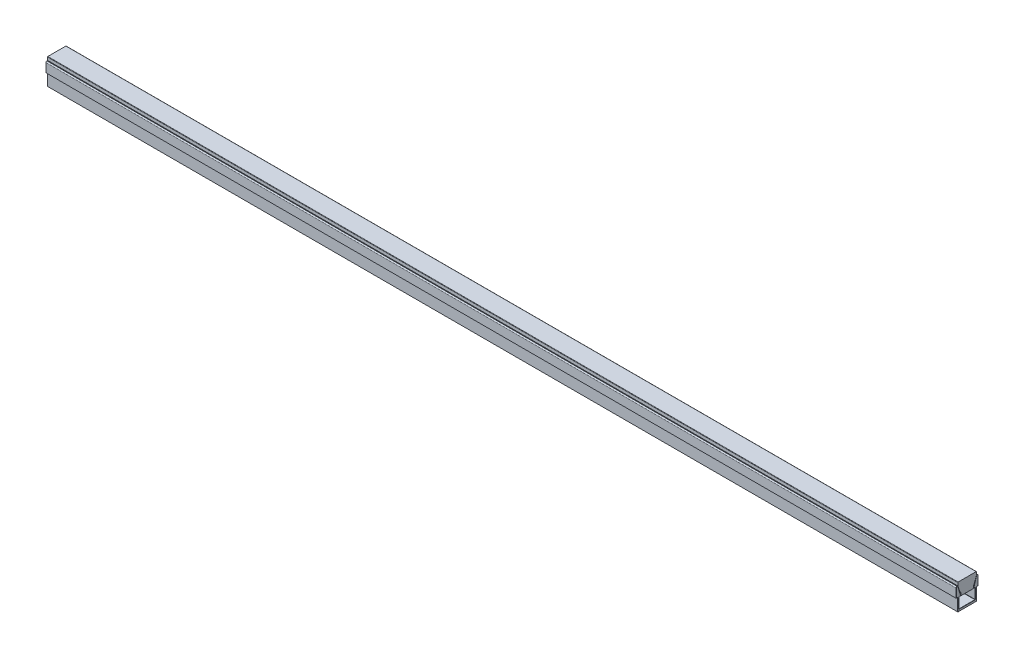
ISO-10303-21;
HEADER;
FILE_DESCRIPTION(('STEP AP214'),'2;1');
FILE_NAME('part.step','',(''),(''),'','','');
FILE_SCHEMA(('AUTOMOTIVE_DESIGN { 1 0 10303 214 1 1 1 1 }'));
ENDSEC;
DATA;
#1=APPLICATION_CONTEXT('core data for automotive mechanical design processes');
#2=APPLICATION_PROTOCOL_DEFINITION('international standard','automotive_design',2000,#1);
#3=PRODUCT_CONTEXT('',#1,'mechanical');
#4=PRODUCT('Part','Part','',(#3));
#5=PRODUCT_RELATED_PRODUCT_CATEGORY('part','',(#4));
#6=PRODUCT_DEFINITION_FORMATION('','',#4);
#7=PRODUCT_DEFINITION_CONTEXT('part definition',#1,'design');
#8=PRODUCT_DEFINITION('design','',#6,#7);
#9=PRODUCT_DEFINITION_SHAPE('','',#8);
#10=(LENGTH_UNIT() NAMED_UNIT(*) SI_UNIT(.MILLI.,.METRE.));
#11=(NAMED_UNIT(*) PLANE_ANGLE_UNIT() SI_UNIT($,.RADIAN.));
#12=(NAMED_UNIT(*) SI_UNIT($,.STERADIAN.) SOLID_ANGLE_UNIT());
#13=UNCERTAINTY_MEASURE_WITH_UNIT(LENGTH_MEASURE(1.E-05),#10,'distance_accuracy_value','');
#14=(GEOMETRIC_REPRESENTATION_CONTEXT(3) GLOBAL_UNCERTAINTY_ASSIGNED_CONTEXT((#13)) GLOBAL_UNIT_ASSIGNED_CONTEXT((#10,
#11,#12)) REPRESENTATION_CONTEXT('',''));
#15=CARTESIAN_POINT('',(0.,0.,0.));
#16=DIRECTION('',(0.,0.,1.));
#17=DIRECTION('',(1.,0.,0.));
#18=AXIS2_PLACEMENT_3D('',#15,#16,#17);
#19=CARTESIAN_POINT('',(254.,14.5,0.));
#20=DIRECTION('',(1.,0.,0.));
#21=DIRECTION('',(0.,0.,-1.));
#22=AXIS2_PLACEMENT_3D('',#19,#20,#21);
#23=PLANE('',#22);
#24=DIRECTION('',(0.,1.,0.));
#25=VECTOR('',#24,1.);
#26=CARTESIAN_POINT('',(254.,7.1,-3.575));
#27=LINE('',#26,#25);
#28=CARTESIAN_POINT('',(254.,7.1,-3.575));
#29=VERTEX_POINT('',#28);
#30=CARTESIAN_POINT('',(254.,8.60000000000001,-3.57500000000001));
#31=VERTEX_POINT('',#30);
#32=EDGE_CURVE('P0_E94',#29,#31,#27,.T.);
#33=ORIENTED_EDGE('',*,*,#32,.T.);
#34=CARTESIAN_POINT('',(254.,19.1995132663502,16.9831586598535));
#35=DIRECTION('',(1.,0.,0.));
#36=DIRECTION('',(0.,0.,1.));
#37=AXIS2_PLACEMENT_3D('',#34,#35,#36);
#38=CIRCLE('',#37,23.1297982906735);
#39=CARTESIAN_POINT('',(254.,12.7,-5.21467673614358));
#40=VERTEX_POINT('',#39);
#41=EDGE_CURVE('P0_E105',#31,#40,#38,.T.);
#42=ORIENTED_EDGE('',*,*,#41,.T.);
#43=DIRECTION('',(0.,-1.,0.));
#44=VECTOR('',#43,1.);
#45=CARTESIAN_POINT('',(254.,14.5,-5.21467673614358));
#46=LINE('',#45,#44);
#47=CARTESIAN_POINT('',(254.,14.3,-5.21467673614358));
#48=VERTEX_POINT('',#47);
#49=EDGE_CURVE('P0_E128',#48,#40,#46,.T.);
#50=ORIENTED_EDGE('',*,*,#49,.F.);
#51=CARTESIAN_POINT('',(254.,14.3,-5.01467673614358));
#52=DIRECTION('',(1.,0.,0.));
#53=DIRECTION('',(0.,0.,-1.));
#54=AXIS2_PLACEMENT_3D('',#51,#52,#53);
#55=CIRCLE('',#54,0.2);
#56=CARTESIAN_POINT('',(254.,14.5,-5.01467673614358));
#57=VERTEX_POINT('',#56);
#58=EDGE_CURVE('P0_E153',#48,#57,#55,.T.);
#59=ORIENTED_EDGE('',*,*,#58,.T.);
#60=DIRECTION('',(0.,0.,1.));
#61=VECTOR('',#60,1.);
#62=CARTESIAN_POINT('',(254.,14.5,0.));
#63=LINE('',#62,#61);
#64=CARTESIAN_POINT('',(254.,14.5,5.01467673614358));
#65=VERTEX_POINT('',#64);
#66=EDGE_CURVE('P0_E132',#57,#65,#63,.T.);
#67=ORIENTED_EDGE('',*,*,#66,.T.);
#68=CARTESIAN_POINT('',(254.,14.3,5.01467673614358));
#69=DIRECTION('',(1.,0.,0.));
#70=DIRECTION('',(0.,0.,-1.));
#71=AXIS2_PLACEMENT_3D('',#68,#69,#70);
#72=CIRCLE('',#71,0.2);
#73=CARTESIAN_POINT('',(254.,14.3,5.21467673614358));
#74=VERTEX_POINT('',#73);
#75=EDGE_CURVE('P0_E24',#65,#74,#72,.T.);
#76=ORIENTED_EDGE('',*,*,#75,.T.);
#77=DIRECTION('',(0.,-1.,0.));
#78=VECTOR('',#77,1.);
#79=CARTESIAN_POINT('',(254.,14.5,5.21467673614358));
#80=LINE('',#79,#78);
#81=CARTESIAN_POINT('',(254.,12.7,5.21467673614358));
#82=VERTEX_POINT('',#81);
#83=EDGE_CURVE('P0_E116',#74,#82,#80,.T.);
#84=ORIENTED_EDGE('',*,*,#83,.T.);
#85=CARTESIAN_POINT('',(254.,19.1995132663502,-16.9831586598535));
#86=DIRECTION('',(-1.,0.,0.));
#87=DIRECTION('',(0.,0.,-1.));
#88=AXIS2_PLACEMENT_3D('',#85,#86,#87);
#89=CIRCLE('',#88,23.1297982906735);
#90=CARTESIAN_POINT('',(254.,8.60000000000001,3.57500000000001));
#91=VERTEX_POINT('',#90);
#92=EDGE_CURVE('P0_E182',#91,#82,#89,.T.);
#93=ORIENTED_EDGE('',*,*,#92,.F.);
#94=DIRECTION('',(0.,1.,0.));
#95=VECTOR('',#94,1.);
#96=CARTESIAN_POINT('',(254.,7.1,3.575));
#97=LINE('',#96,#95);
#98=CARTESIAN_POINT('',(254.,7.1,3.575));
#99=VERTEX_POINT('',#98);
#100=EDGE_CURVE('P0_E112',#99,#91,#97,.T.);
#101=ORIENTED_EDGE('',*,*,#100,.F.);
#102=DIRECTION('',(0.,0.,-1.));
#103=VECTOR('',#102,1.);
#104=CARTESIAN_POINT('',(254.,7.1,3.575));
#105=LINE('',#104,#103);
#106=EDGE_CURVE('P0_E109',#99,#29,#105,.T.);
#107=ORIENTED_EDGE('',*,*,#106,.T.);
#108=EDGE_LOOP('',(#33,#42,#50,#59,#67,#76,#84,#93,#101,#107));
#109=FACE_BOUND('',#108,.T.);
#110=ADVANCED_FACE('P0_F16',(#109),#23,.T.);
#111=CARTESIAN_POINT('',(-254.,14.5,0.));
#112=DIRECTION('',(1.,0.,0.));
#113=DIRECTION('',(0.,0.,-1.));
#114=AXIS2_PLACEMENT_3D('',#111,#112,#113);
#115=PLANE('',#114);
#116=CARTESIAN_POINT('',(-254.,19.1995132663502,16.9831586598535));
#117=DIRECTION('',(1.,0.,0.));
#118=DIRECTION('',(0.,0.,-1.));
#119=AXIS2_PLACEMENT_3D('',#116,#117,#118);
#120=CIRCLE('',#119,23.1297982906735);
#121=CARTESIAN_POINT('',(-254.,12.7,-5.21467673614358));
#122=VERTEX_POINT('',#121);
#123=CARTESIAN_POINT('',(-254.,8.60000000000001,-3.57500000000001));
#124=VERTEX_POINT('',#123);
#125=EDGE_CURVE('P0_E188',#122,#124,#120,.F.);
#126=ORIENTED_EDGE('',*,*,#125,.T.);
#127=DIRECTION('',(0.,-1.,0.));
#128=VECTOR('',#127,1.);
#129=CARTESIAN_POINT('',(-254.,7.1,-3.575));
#130=LINE('',#129,#128);
#131=CARTESIAN_POINT('',(-254.,7.1,-3.575));
#132=VERTEX_POINT('',#131);
#133=EDGE_CURVE('P0_E185',#124,#132,#130,.T.);
#134=ORIENTED_EDGE('',*,*,#133,.T.);
#135=DIRECTION('',(0.,0.,-1.));
#136=VECTOR('',#135,1.);
#137=CARTESIAN_POINT('',(-254.,7.1,3.575));
#138=LINE('',#137,#136);
#139=CARTESIAN_POINT('',(-254.,7.1,3.575));
#140=VERTEX_POINT('',#139);
#141=EDGE_CURVE('P0_E121',#140,#132,#138,.T.);
#142=ORIENTED_EDGE('',*,*,#141,.F.);
#143=DIRECTION('',(0.,-1.,0.));
#144=VECTOR('',#143,1.);
#145=CARTESIAN_POINT('',(-254.,7.1,3.575));
#146=LINE('',#145,#144);
#147=CARTESIAN_POINT('',(-254.,8.60000000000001,3.57500000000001));
#148=VERTEX_POINT('',#147);
#149=EDGE_CURVE('P0_E177',#148,#140,#146,.T.);
#150=ORIENTED_EDGE('',*,*,#149,.F.);
#151=CARTESIAN_POINT('',(-254.,19.1995132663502,-16.9831586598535));
#152=DIRECTION('',(1.,0.,0.));
#153=DIRECTION('',(0.,0.,-1.));
#154=AXIS2_PLACEMENT_3D('',#151,#152,#153);
#155=CIRCLE('',#154,23.1297982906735);
#156=CARTESIAN_POINT('',(-254.,12.7,5.21467673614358));
#157=VERTEX_POINT('',#156);
#158=EDGE_CURVE('P0_E175',#157,#148,#155,.T.);
#159=ORIENTED_EDGE('',*,*,#158,.F.);
#160=DIRECTION('',(0.,-1.,0.));
#161=VECTOR('',#160,1.);
#162=CARTESIAN_POINT('',(-254.,14.5,5.21467673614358));
#163=LINE('',#162,#161);
#164=CARTESIAN_POINT('',(-254.,14.3,5.21467673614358));
#165=VERTEX_POINT('',#164);
#166=EDGE_CURVE('P0_E125',#165,#157,#163,.T.);
#167=ORIENTED_EDGE('',*,*,#166,.F.);
#168=CARTESIAN_POINT('',(-254.,14.3,5.01467673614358));
#169=DIRECTION('',(1.,0.,0.));
#170=DIRECTION('',(0.,0.,-1.));
#171=AXIS2_PLACEMENT_3D('',#168,#169,#170);
#172=CIRCLE('',#171,0.2);
#173=CARTESIAN_POINT('',(-254.,14.5,5.01467673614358));
#174=VERTEX_POINT('',#173);
#175=EDGE_CURVE('P0_E147',#165,#174,#172,.F.);
#176=ORIENTED_EDGE('',*,*,#175,.T.);
#177=DIRECTION('',(0.,0.,1.));
#178=VECTOR('',#177,1.);
#179=CARTESIAN_POINT('',(-254.,14.5,0.));
#180=LINE('',#179,#178);
#181=CARTESIAN_POINT('',(-254.,14.5,-5.01467673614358));
#182=VERTEX_POINT('',#181);
#183=EDGE_CURVE('P0_E122',#182,#174,#180,.T.);
#184=ORIENTED_EDGE('',*,*,#183,.F.);
#185=CARTESIAN_POINT('',(-254.,14.3,-5.01467673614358));
#186=DIRECTION('',(1.,0.,0.));
#187=DIRECTION('',(0.,0.,-1.));
#188=AXIS2_PLACEMENT_3D('',#185,#186,#187);
#189=CIRCLE('',#188,0.2);
#190=CARTESIAN_POINT('',(-254.,14.3,-5.21467673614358));
#191=VERTEX_POINT('',#190);
#192=EDGE_CURVE('P0_E145',#182,#191,#189,.F.);
#193=ORIENTED_EDGE('',*,*,#192,.T.);
#194=DIRECTION('',(0.,-1.,0.));
#195=VECTOR('',#194,1.);
#196=CARTESIAN_POINT('',(-254.,14.5,-5.21467673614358));
#197=LINE('',#196,#195);
#198=EDGE_CURVE('P0_E173',#191,#122,#197,.T.);
#199=ORIENTED_EDGE('',*,*,#198,.T.);
#200=EDGE_LOOP('',(#126,#134,#142,#150,#159,#167,#176,#184,#193,#199));
#201=FACE_BOUND('',#200,.T.);
#202=ADVANCED_FACE('P0_F166',(#201),#115,.F.);
#203=CARTESIAN_POINT('',(254.,14.5,0.));
#204=DIRECTION('',(0.,-1.,0.));
#205=DIRECTION('',(0.,0.,-1.));
#206=AXIS2_PLACEMENT_3D('',#203,#204,#205);
#207=PLANE('',#206);
#208=ORIENTED_EDGE('',*,*,#183,.T.);
#209=DIRECTION('',(-1.,0.,0.));
#210=VECTOR('',#209,1.);
#211=CARTESIAN_POINT('',(254.,14.5,5.01467673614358));
#212=LINE('',#211,#210);
#213=EDGE_CURVE('P0_E37',#174,#65,#212,.F.);
#214=ORIENTED_EDGE('',*,*,#213,.T.);
#215=ORIENTED_EDGE('',*,*,#66,.F.);
#216=DIRECTION('',(-1.,0.,0.));
#217=VECTOR('',#216,1.);
#218=CARTESIAN_POINT('',(-254.,14.5,-5.01467673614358));
#219=LINE('',#218,#217);
#220=EDGE_CURVE('P0_E149',#57,#182,#219,.T.);
#221=ORIENTED_EDGE('',*,*,#220,.T.);
#222=EDGE_LOOP('',(#208,#214,#215,#221));
#223=FACE_BOUND('',#222,.T.);
#224=ADVANCED_FACE('P0_F168',(#223),#207,.F.);
#225=CARTESIAN_POINT('',(254.,14.5,5.21467673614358));
#226=DIRECTION('',(0.,0.,-1.));
#227=DIRECTION('',(0.,1.,0.));
#228=AXIS2_PLACEMENT_3D('',#225,#226,#227);
#229=PLANE('',#228);
#230=ORIENTED_EDGE('',*,*,#83,.F.);
#231=DIRECTION('',(-1.,0.,0.));
#232=VECTOR('',#231,1.);
#233=CARTESIAN_POINT('',(254.,14.3,5.21467673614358));
#234=LINE('',#233,#232);
#235=EDGE_CURVE('P0_E142',#74,#165,#234,.T.);
#236=ORIENTED_EDGE('',*,*,#235,.T.);
#237=ORIENTED_EDGE('',*,*,#166,.T.);
#238=DIRECTION('',(-1.,0.,0.));
#239=VECTOR('',#238,1.);
#240=CARTESIAN_POINT('',(254.,12.7,5.21467673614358));
#241=LINE('',#240,#239);
#242=EDGE_CURVE('P0_E140',#82,#157,#241,.T.);
#243=ORIENTED_EDGE('',*,*,#242,.F.);
#244=EDGE_LOOP('',(#230,#236,#237,#243));
#245=FACE_BOUND('',#244,.T.);
#246=ADVANCED_FACE('P0_F160',(#245),#229,.F.);
#247=CARTESIAN_POINT('',(254.,7.1,3.575));
#248=DIRECTION('',(0.,1.,0.));
#249=DIRECTION('',(0.,0.,1.));
#250=AXIS2_PLACEMENT_3D('',#247,#248,#249);
#251=PLANE('',#250);
#252=ORIENTED_EDGE('',*,*,#141,.T.);
#253=DIRECTION('',(-1.,0.,0.));
#254=VECTOR('',#253,1.);
#255=CARTESIAN_POINT('',(254.,7.1,-3.575));
#256=LINE('',#255,#254);
#257=EDGE_CURVE('P0_E98',#29,#132,#256,.T.);
#258=ORIENTED_EDGE('',*,*,#257,.F.);
#259=ORIENTED_EDGE('',*,*,#106,.F.);
#260=DIRECTION('',(-1.,0.,0.));
#261=VECTOR('',#260,1.);
#262=CARTESIAN_POINT('',(254.,7.1,3.575));
#263=LINE('',#262,#261);
#264=EDGE_CURVE('P0_E115',#99,#140,#263,.T.);
#265=ORIENTED_EDGE('',*,*,#264,.T.);
#266=EDGE_LOOP('',(#252,#258,#259,#265));
#267=FACE_BOUND('',#266,.T.);
#268=ADVANCED_FACE('P0_F119',(#267),#251,.F.);
#269=CARTESIAN_POINT('',(254.,14.5,-5.21467673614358));
#270=DIRECTION('',(0.,0.,-1.));
#271=DIRECTION('',(0.,1.,0.));
#272=AXIS2_PLACEMENT_3D('',#269,#270,#271);
#273=PLANE('',#272);
#274=ORIENTED_EDGE('',*,*,#198,.F.);
#275=DIRECTION('',(-1.,0.,0.));
#276=VECTOR('',#275,1.);
#277=CARTESIAN_POINT('',(254.,14.3,-5.21467673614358));
#278=LINE('',#277,#276);
#279=EDGE_CURVE('P0_E11',#191,#48,#278,.F.);
#280=ORIENTED_EDGE('',*,*,#279,.T.);
#281=ORIENTED_EDGE('',*,*,#49,.T.);
#282=DIRECTION('',(-1.,0.,0.));
#283=VECTOR('',#282,1.);
#284=CARTESIAN_POINT('',(254.,12.7,-5.21467673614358));
#285=LINE('',#284,#283);
#286=EDGE_CURVE('P0_E123',#40,#122,#285,.T.);
#287=ORIENTED_EDGE('',*,*,#286,.T.);
#288=EDGE_LOOP('',(#274,#280,#281,#287));
#289=FACE_BOUND('',#288,.T.);
#290=ADVANCED_FACE('P0_F174',(#289),#273,.T.);
#291=CARTESIAN_POINT('',(254.,14.3,5.01467673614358));
#292=DIRECTION('',(-1.,0.,0.));
#293=DIRECTION('',(0.,0.,1.));
#294=AXIS2_PLACEMENT_3D('',#291,#292,#293);
#295=CYLINDRICAL_SURFACE('',#294,0.2);
#296=ORIENTED_EDGE('',*,*,#75,.F.);
#297=ORIENTED_EDGE('',*,*,#213,.F.);
#298=ORIENTED_EDGE('',*,*,#175,.F.);
#299=ORIENTED_EDGE('',*,*,#235,.F.);
#300=EDGE_LOOP('',(#296,#297,#298,#299));
#301=FACE_BOUND('',#300,.T.);
#302=ADVANCED_FACE('P0_F162',(#301),#295,.T.);
#303=CARTESIAN_POINT('',(254.,14.3,-5.01467673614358));
#304=DIRECTION('',(1.,0.,0.));
#305=DIRECTION('',(0.,0.,-1.));
#306=AXIS2_PLACEMENT_3D('',#303,#304,#305);
#307=CYLINDRICAL_SURFACE('',#306,0.2);
#308=ORIENTED_EDGE('',*,*,#58,.F.);
#309=ORIENTED_EDGE('',*,*,#279,.F.);
#310=ORIENTED_EDGE('',*,*,#192,.F.);
#311=ORIENTED_EDGE('',*,*,#220,.F.);
#312=EDGE_LOOP('',(#308,#309,#310,#311));
#313=FACE_BOUND('',#312,.T.);
#314=ADVANCED_FACE('P0_F18',(#313),#307,.T.);
#315=CARTESIAN_POINT('',(-259.835112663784,7.1,3.575));
#316=DIRECTION('',(0.,0.,-1.));
#317=DIRECTION('',(-1.,0.,0.));
#318=AXIS2_PLACEMENT_3D('',#315,#316,#317);
#319=PLANE('',#318);
#320=ORIENTED_EDGE('',*,*,#149,.T.);
#321=ORIENTED_EDGE('',*,*,#264,.F.);
#322=ORIENTED_EDGE('',*,*,#100,.T.);
#323=DIRECTION('',(1.,0.,0.));
#324=VECTOR('',#323,1.);
#325=CARTESIAN_POINT('',(-259.835112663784,8.60000000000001,3.57500000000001));
#326=LINE('',#325,#324);
#327=EDGE_CURVE('P0_E180',#148,#91,#326,.T.);
#328=ORIENTED_EDGE('',*,*,#327,.F.);
#329=EDGE_LOOP('',(#320,#321,#322,#328));
#330=FACE_BOUND('',#329,.T.);
#331=ADVANCED_FACE('P0_F202',(#330),#319,.F.);
#332=CARTESIAN_POINT('',(-259.835112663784,19.1995132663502,-16.9831586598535));
#333=DIRECTION('',(1.,0.,0.));
#334=DIRECTION('',(0.,0.,-1.));
#335=AXIS2_PLACEMENT_3D('',#332,#333,#334);
#336=CYLINDRICAL_SURFACE('',#335,23.1297982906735);
#337=ORIENTED_EDGE('',*,*,#158,.T.);
#338=ORIENTED_EDGE('',*,*,#327,.T.);
#339=ORIENTED_EDGE('',*,*,#92,.T.);
#340=ORIENTED_EDGE('',*,*,#242,.T.);
#341=EDGE_LOOP('',(#337,#338,#339,#340));
#342=FACE_BOUND('',#341,.T.);
#343=ADVANCED_FACE('P0_F194',(#342),#336,.T.);
#344=CARTESIAN_POINT('',(-259.835112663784,19.1995132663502,16.9831586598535));
#345=DIRECTION('',(1.,0.,0.));
#346=DIRECTION('',(0.,0.,-1.));
#347=AXIS2_PLACEMENT_3D('',#344,#345,#346);
#348=CYLINDRICAL_SURFACE('',#347,23.1297982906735);
#349=ORIENTED_EDGE('',*,*,#286,.F.);
#350=ORIENTED_EDGE('',*,*,#41,.F.);
#351=DIRECTION('',(1.,0.,0.));
#352=VECTOR('',#351,1.);
#353=CARTESIAN_POINT('',(-259.835112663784,8.60000000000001,-3.57500000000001));
#354=LINE('',#353,#352);
#355=EDGE_CURVE('P0_E101',#124,#31,#354,.T.);
#356=ORIENTED_EDGE('',*,*,#355,.F.);
#357=ORIENTED_EDGE('',*,*,#125,.F.);
#358=EDGE_LOOP('',(#349,#350,#356,#357));
#359=FACE_BOUND('',#358,.T.);
#360=ADVANCED_FACE('P0_F192',(#359),#348,.T.);
#361=CARTESIAN_POINT('',(-259.835112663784,7.1,-3.575));
#362=DIRECTION('',(0.,0.,-1.));
#363=DIRECTION('',(-1.,0.,0.));
#364=AXIS2_PLACEMENT_3D('',#361,#362,#363);
#365=PLANE('',#364);
#366=ORIENTED_EDGE('',*,*,#355,.T.);
#367=ORIENTED_EDGE('',*,*,#32,.F.);
#368=ORIENTED_EDGE('',*,*,#257,.T.);
#369=ORIENTED_EDGE('',*,*,#133,.F.);
#370=EDGE_LOOP('',(#366,#367,#368,#369));
#371=FACE_BOUND('',#370,.T.);
#372=ADVANCED_FACE('P0_F96',(#371),#365,.T.);
#373=CLOSED_SHELL('',(#110,#202,#224,#246,#268,#290,#302,#314,#331,#343,#360,#372));
#374=MANIFOLD_SOLID_BREP('P0_B1',#373);
#375=CARTESIAN_POINT('',(-254.,0.,0.));
#376=DIRECTION('',(-1.,0.,0.));
#377=DIRECTION('',(0.,0.,1.));
#378=AXIS2_PLACEMENT_3D('',#375,#376,#377);
#379=PLANE('',#378);
#380=CARTESIAN_POINT('',(-254.,12.1,-5.64871663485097));
#381=DIRECTION('',(-1.,0.,0.));
#382=DIRECTION('',(0.,0.,1.));
#383=AXIS2_PLACEMENT_3D('',#380,#381,#382);
#384=CIRCLE('',#383,0.6);
#385=CARTESIAN_POINT('',(-254.,12.5594552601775,-5.26283988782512));
#386=VERTEX_POINT('',#385);
#387=CARTESIAN_POINT('',(-254.,12.6979663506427,-5.59935831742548));
#388=VERTEX_POINT('',#387);
#389=EDGE_CURVE('P1_E813',#386,#388,#384,.T.);
#390=ORIENTED_EDGE('',*,*,#389,.T.);
#391=CARTESIAN_POINT('',(-254.,12.1,-5.55));
#392=DIRECTION('',(-1.,0.,0.));
#393=DIRECTION('',(0.,0.,1.));
#394=AXIS2_PLACEMENT_3D('',#391,#392,#393);
#395=CIRCLE('',#394,0.6);
#396=CARTESIAN_POINT('',(-254.,12.4316624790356,-6.05000000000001));
#397=VERTEX_POINT('',#396);
#398=EDGE_CURVE('P1_E815',#388,#397,#395,.T.);
#399=ORIENTED_EDGE('',*,*,#398,.T.);
#400=DIRECTION('',(0.,-1.,0.));
#401=VECTOR('',#400,1.);
#402=CARTESIAN_POINT('',(-254.,0.,-6.05000000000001));
#403=LINE('',#402,#401);
#404=CARTESIAN_POINT('',(-254.,7.19999999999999,-6.05000000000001));
#405=VERTEX_POINT('',#404);
#406=EDGE_CURVE('P1_E486',#397,#405,#403,.T.);
#407=ORIENTED_EDGE('',*,*,#406,.T.);
#408=DIRECTION('',(0.,0.,1.));
#409=VECTOR('',#408,1.);
#410=CARTESIAN_POINT('',(-254.,7.19999999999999,0.));
#411=LINE('',#410,#409);
#412=CARTESIAN_POINT('',(-254.,7.19999999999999,-5.29999999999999));
#413=VERTEX_POINT('',#412);
#414=EDGE_CURVE('P1_E484',#405,#413,#411,.T.);
#415=ORIENTED_EDGE('',*,*,#414,.T.);
#416=DIRECTION('',(0.,0.707106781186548,-0.707106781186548));
#417=VECTOR('',#416,1.);
#418=CARTESIAN_POINT('',(-254.,0.950000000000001,0.950000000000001));
#419=LINE('',#418,#417);
#420=CARTESIAN_POINT('',(-254.,7.1,-5.2));
#421=VERTEX_POINT('',#420);
#422=EDGE_CURVE('P1_E481',#421,#413,#419,.T.);
#423=ORIENTED_EDGE('',*,*,#422,.F.);
#424=DIRECTION('',(0.,0.707106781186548,-0.707106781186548));
#425=VECTOR('',#424,1.);
#426=CARTESIAN_POINT('',(-254.,0.950000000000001,0.950000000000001));
#427=LINE('',#426,#425);
#428=CARTESIAN_POINT('',(-254.,7.00000000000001,-5.10000000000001));
#429=VERTEX_POINT('',#428);
#430=EDGE_CURVE('P1_E478',#429,#421,#427,.T.);
#431=ORIENTED_EDGE('',*,*,#430,.F.);
#432=DIRECTION('',(0.,-1.,0.));
#433=VECTOR('',#432,1.);
#434=CARTESIAN_POINT('',(-254.,0.,-5.10000000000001));
#435=LINE('',#434,#433);
#436=CARTESIAN_POINT('',(-254.,0.0999999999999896,-5.10000000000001));
#437=VERTEX_POINT('',#436);
#438=EDGE_CURVE('P1_E476',#429,#437,#435,.T.);
#439=ORIENTED_EDGE('',*,*,#438,.T.);
#440=DIRECTION('',(0.,0.,1.));
#441=VECTOR('',#440,1.);
#442=CARTESIAN_POINT('',(-254.,0.0999999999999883,5.2));
#443=LINE('',#442,#441);
#444=CARTESIAN_POINT('',(-254.,0.0999999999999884,5.10000000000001));
#445=VERTEX_POINT('',#444);
#446=EDGE_CURVE('P1_E474',#437,#445,#443,.T.);
#447=ORIENTED_EDGE('',*,*,#446,.T.);
#448=DIRECTION('',(0.,1.,0.));
#449=VECTOR('',#448,1.);
#450=CARTESIAN_POINT('',(-254.,7.1,5.10000000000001));
#451=LINE('',#450,#449);
#452=CARTESIAN_POINT('',(-254.,7.00000000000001,5.10000000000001));
#453=VERTEX_POINT('',#452);
#454=EDGE_CURVE('P1_E472',#445,#453,#451,.T.);
#455=ORIENTED_EDGE('',*,*,#454,.T.);
#456=DIRECTION('',(0.,-0.707106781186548,-0.707106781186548));
#457=VECTOR('',#456,1.);
#458=CARTESIAN_POINT('',(-254.,0.950000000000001,-0.950000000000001));
#459=LINE('',#458,#457);
#460=CARTESIAN_POINT('',(-254.,7.1,5.2));
#461=VERTEX_POINT('',#460);
#462=EDGE_CURVE('P1_E469',#461,#453,#459,.T.);
#463=ORIENTED_EDGE('',*,*,#462,.F.);
#464=DIRECTION('',(0.,-0.707106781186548,-0.707106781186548));
#465=VECTOR('',#464,1.);
#466=CARTESIAN_POINT('',(-254.,0.950000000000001,-0.950000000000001));
#467=LINE('',#466,#465);
#468=CARTESIAN_POINT('',(-254.,7.19999999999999,5.29999999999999));
#469=VERTEX_POINT('',#468);
#470=EDGE_CURVE('P1_E466',#469,#461,#467,.T.);
#471=ORIENTED_EDGE('',*,*,#470,.F.);
#472=DIRECTION('',(0.,0.,1.));
#473=VECTOR('',#472,1.);
#474=CARTESIAN_POINT('',(-254.,7.19999999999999,6.15));
#475=LINE('',#474,#473);
#476=CARTESIAN_POINT('',(-254.,7.19999999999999,6.05000000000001));
#477=VERTEX_POINT('',#476);
#478=EDGE_CURVE('P1_E464',#469,#477,#475,.T.);
#479=ORIENTED_EDGE('',*,*,#478,.T.);
#480=DIRECTION('',(0.,1.,0.));
#481=VECTOR('',#480,1.);
#482=CARTESIAN_POINT('',(-254.,12.7,6.05000000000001));
#483=LINE('',#482,#481);
#484=CARTESIAN_POINT('',(-254.,12.4316624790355,6.05000000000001));
#485=VERTEX_POINT('',#484);
#486=EDGE_CURVE('P1_E461',#477,#485,#483,.T.);
#487=ORIENTED_EDGE('',*,*,#486,.T.);
#488=CARTESIAN_POINT('',(-254.,12.1,5.55));
#489=DIRECTION('',(-1.,0.,0.));
#490=DIRECTION('',(0.,0.,1.));
#491=AXIS2_PLACEMENT_3D('',#488,#489,#490);
#492=CIRCLE('',#491,0.6);
#493=CARTESIAN_POINT('',(-254.,12.6979663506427,5.59935831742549));
#494=VERTEX_POINT('',#493);
#495=EDGE_CURVE('P1_E811',#485,#494,#492,.T.);
#496=ORIENTED_EDGE('',*,*,#495,.T.);
#497=CARTESIAN_POINT('',(-254.,12.1,5.64871663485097));
#498=DIRECTION('',(-1.,0.,0.));
#499=DIRECTION('',(0.,0.,1.));
#500=AXIS2_PLACEMENT_3D('',#497,#498,#499);
#501=CIRCLE('',#500,0.6);
#502=CARTESIAN_POINT('',(-254.,12.5594552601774,5.26283988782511));
#503=VERTEX_POINT('',#502);
#504=EDGE_CURVE('P1_E604',#494,#503,#501,.T.);
#505=ORIENTED_EDGE('',*,*,#504,.T.);
#506=DIRECTION('',(0.,-0.959229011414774,-0.282629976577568));
#507=VECTOR('',#506,1.);
#508=CARTESIAN_POINT('',(-254.,7.07173700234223,3.64592290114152));
#509=LINE('',#508,#507);
#510=CARTESIAN_POINT('',(-254.,7.20000000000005,3.68371467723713));
#511=VERTEX_POINT('',#510);
#512=EDGE_CURVE('P1_E488',#503,#511,#509,.T.);
#513=ORIENTED_EDGE('',*,*,#512,.T.);
#514=DIRECTION('',(0.,0.,1.));
#515=VECTOR('',#514,1.);
#516=CARTESIAN_POINT('',(-254.,7.20000000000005,4.5));
#517=LINE('',#516,#515);
#518=CARTESIAN_POINT('',(-254.,7.20000000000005,4.39999999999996));
#519=VERTEX_POINT('',#518);
#520=EDGE_CURVE('P1_E490',#511,#519,#517,.T.);
#521=ORIENTED_EDGE('',*,*,#520,.T.);
#522=DIRECTION('',(0.,0.707106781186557,-0.707106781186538));
#523=VECTOR('',#522,1.);
#524=CARTESIAN_POINT('',(-254.,5.79999999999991,5.80000000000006));
#525=LINE('',#524,#523);
#526=CARTESIAN_POINT('',(-254.,7.1,4.5));
#527=VERTEX_POINT('',#526);
#528=EDGE_CURVE('P1_E492',#527,#519,#525,.T.);
#529=ORIENTED_EDGE('',*,*,#528,.F.);
#530=DIRECTION('',(0.,0.707106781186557,-0.707106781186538));
#531=VECTOR('',#530,1.);
#532=CARTESIAN_POINT('',(-254.,5.79999999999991,5.80000000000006));
#533=LINE('',#532,#531);
#534=CARTESIAN_POINT('',(-254.,6.99999999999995,4.60000000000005));
#535=VERTEX_POINT('',#534);
#536=EDGE_CURVE('P1_E495',#535,#527,#533,.T.);
#537=ORIENTED_EDGE('',*,*,#536,.F.);
#538=DIRECTION('',(0.,-1.,0.));
#539=VECTOR('',#538,1.);
#540=CARTESIAN_POINT('',(-254.,1.2,4.60000000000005));
#541=LINE('',#540,#539);
#542=CARTESIAN_POINT('',(-254.,1.30000000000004,4.60000000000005));
#543=VERTEX_POINT('',#542);
#544=EDGE_CURVE('P1_E498',#535,#543,#541,.T.);
#545=ORIENTED_EDGE('',*,*,#544,.T.);
#546=DIRECTION('',(0.,0.707106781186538,0.707106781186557));
#547=VECTOR('',#546,1.);
#548=CARTESIAN_POINT('',(-254.,-1.64999999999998,1.64999999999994));
#549=LINE('',#548,#547);
#550=CARTESIAN_POINT('',(-254.,1.2,4.5));
#551=VERTEX_POINT('',#550);
#552=EDGE_CURVE('P1_E500',#551,#543,#549,.T.);
#553=ORIENTED_EDGE('',*,*,#552,.F.);
#554=DIRECTION('',(0.,0.707106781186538,0.707106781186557));
#555=VECTOR('',#554,1.);
#556=CARTESIAN_POINT('',(-254.,-1.64999999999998,1.64999999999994));
#557=LINE('',#556,#555);
#558=CARTESIAN_POINT('',(-254.,1.09999999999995,4.39999999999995));
#559=VERTEX_POINT('',#558);
#560=EDGE_CURVE('P1_E503',#559,#551,#557,.T.);
#561=ORIENTED_EDGE('',*,*,#560,.F.);
#562=DIRECTION('',(0.,0.,-1.));
#563=VECTOR('',#562,1.);
#564=CARTESIAN_POINT('',(-254.,1.09999999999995,-4.5));
#565=LINE('',#564,#563);
#566=CARTESIAN_POINT('',(-254.,1.09999999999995,-4.39999999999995));
#567=VERTEX_POINT('',#566);
#568=EDGE_CURVE('P1_E506',#559,#567,#565,.T.);
#569=ORIENTED_EDGE('',*,*,#568,.T.);
#570=DIRECTION('',(0.,-0.707106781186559,0.707106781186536));
#571=VECTOR('',#570,1.);
#572=CARTESIAN_POINT('',(-254.,-1.65000000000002,-1.65000000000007));
#573=LINE('',#572,#571);
#574=CARTESIAN_POINT('',(-254.,1.2,-4.5));
#575=VERTEX_POINT('',#574);
#576=EDGE_CURVE('P1_E508',#575,#567,#573,.T.);
#577=ORIENTED_EDGE('',*,*,#576,.F.);
#578=DIRECTION('',(0.,-0.707106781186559,0.707106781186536));
#579=VECTOR('',#578,1.);
#580=CARTESIAN_POINT('',(-254.,-1.65000000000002,-1.65000000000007));
#581=LINE('',#580,#579);
#582=CARTESIAN_POINT('',(-254.,1.30000000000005,-4.60000000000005));
#583=VERTEX_POINT('',#582);
#584=EDGE_CURVE('P1_E511',#583,#575,#581,.T.);
#585=ORIENTED_EDGE('',*,*,#584,.F.);
#586=DIRECTION('',(0.,1.,0.));
#587=VECTOR('',#586,1.);
#588=CARTESIAN_POINT('',(-254.,0.,-4.60000000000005));
#589=LINE('',#588,#587);
#590=CARTESIAN_POINT('',(-254.,6.99999999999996,-4.60000000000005));
#591=VERTEX_POINT('',#590);
#592=EDGE_CURVE('P1_E514',#583,#591,#589,.T.);
#593=ORIENTED_EDGE('',*,*,#592,.T.);
#594=DIRECTION('',(0.,-0.707106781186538,-0.707106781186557));
#595=VECTOR('',#594,1.);
#596=CARTESIAN_POINT('',(-254.,5.80000000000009,-5.79999999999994));
#597=LINE('',#596,#595);
#598=CARTESIAN_POINT('',(-254.,7.1,-4.5));
#599=VERTEX_POINT('',#598);
#600=EDGE_CURVE('P1_E516',#599,#591,#597,.T.);
#601=ORIENTED_EDGE('',*,*,#600,.F.);
#602=DIRECTION('',(0.,-0.707106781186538,-0.707106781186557));
#603=VECTOR('',#602,1.);
#604=CARTESIAN_POINT('',(-254.,5.80000000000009,-5.79999999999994));
#605=LINE('',#604,#603);
#606=CARTESIAN_POINT('',(-254.,7.20000000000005,-4.39999999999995));
#607=VERTEX_POINT('',#606);
#608=EDGE_CURVE('P1_E519',#607,#599,#605,.T.);
#609=ORIENTED_EDGE('',*,*,#608,.F.);
#610=DIRECTION('',(0.,0.,1.));
#611=VECTOR('',#610,1.);
#612=CARTESIAN_POINT('',(-254.,7.20000000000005,0.));
#613=LINE('',#612,#611);
#614=CARTESIAN_POINT('',(-254.,7.20000000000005,-3.68371467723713));
#615=VERTEX_POINT('',#614);
#616=EDGE_CURVE('P1_E522',#607,#615,#613,.T.);
#617=ORIENTED_EDGE('',*,*,#616,.T.);
#618=DIRECTION('',(0.,0.959229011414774,-0.282629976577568));
#619=VECTOR('',#618,1.);
#620=CARTESIAN_POINT('',(-254.,-0.423546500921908,-1.43749115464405));
#621=LINE('',#620,#619);
#622=EDGE_CURVE('P1_E524',#615,#386,#621,.T.);
#623=ORIENTED_EDGE('',*,*,#622,.T.);
#624=EDGE_LOOP('',(#390,#399,#407,#415,#423,#431,#439,#447,#455,#463,#471,#479,#487,#496,#505,
#513,#521,#529,#537,#545,#553,#561,#569,#577,#585,#593,#601,#609,#617,#623));
#625=FACE_BOUND('',#624,.T.);
#626=ADVANCED_FACE('P1_F15',(#625),#379,.T.);
#627=CARTESIAN_POINT('',(254.,0.,0.));
#628=DIRECTION('',(-1.,0.,0.));
#629=DIRECTION('',(0.,0.,1.));
#630=AXIS2_PLACEMENT_3D('',#627,#628,#629);
#631=PLANE('',#630);
#632=DIRECTION('',(0.,1.,0.));
#633=VECTOR('',#632,1.);
#634=CARTESIAN_POINT('',(254.,12.7,-6.05000000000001));
#635=LINE('',#634,#633);
#636=CARTESIAN_POINT('',(254.,7.19999999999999,-6.05000000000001));
#637=VERTEX_POINT('',#636);
#638=CARTESIAN_POINT('',(254.,12.4316624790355,-6.05000000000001));
#639=VERTEX_POINT('',#638);
#640=EDGE_CURVE('P1_E399',#637,#639,#635,.T.);
#641=ORIENTED_EDGE('',*,*,#640,.T.);
#642=CARTESIAN_POINT('',(254.,12.1,-5.55));
#643=DIRECTION('',(-1.,0.,0.));
#644=DIRECTION('',(0.,0.,1.));
#645=AXIS2_PLACEMENT_3D('',#642,#643,#644);
#646=CIRCLE('',#645,0.6);
#647=CARTESIAN_POINT('',(254.,12.6979663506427,-5.59935831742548));
#648=VERTEX_POINT('',#647);
#649=EDGE_CURVE('P1_E830',#639,#648,#646,.F.);
#650=ORIENTED_EDGE('',*,*,#649,.T.);
#651=CARTESIAN_POINT('',(254.,12.1,-5.64871663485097));
#652=DIRECTION('',(-1.,0.,0.));
#653=DIRECTION('',(0.,0.,1.));
#654=AXIS2_PLACEMENT_3D('',#651,#652,#653);
#655=CIRCLE('',#654,0.6);
#656=CARTESIAN_POINT('',(254.,12.5594552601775,-5.26283988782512));
#657=VERTEX_POINT('',#656);
#658=EDGE_CURVE('P1_E828',#648,#657,#655,.F.);
#659=ORIENTED_EDGE('',*,*,#658,.T.);
#660=DIRECTION('',(0.,-0.959229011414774,0.282629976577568));
#661=VECTOR('',#660,1.);
#662=CARTESIAN_POINT('',(254.,7.07173700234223,-3.64592290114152));
#663=LINE('',#662,#661);
#664=CARTESIAN_POINT('',(254.,7.20000000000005,-3.68371467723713));
#665=VERTEX_POINT('',#664);
#666=EDGE_CURVE('P1_E430',#657,#665,#663,.T.);
#667=ORIENTED_EDGE('',*,*,#666,.T.);
#668=DIRECTION('',(0.,0.,-1.));
#669=VECTOR('',#668,1.);
#670=CARTESIAN_POINT('',(254.,7.20000000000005,-4.5));
#671=LINE('',#670,#669);
#672=CARTESIAN_POINT('',(254.,7.20000000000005,-4.39999999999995));
#673=VERTEX_POINT('',#672);
#674=EDGE_CURVE('P1_E426',#665,#673,#671,.T.);
#675=ORIENTED_EDGE('',*,*,#674,.T.);
#676=DIRECTION('',(0.,0.707106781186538,0.707106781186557));
#677=VECTOR('',#676,1.);
#678=CARTESIAN_POINT('',(254.,7.20000000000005,-4.39999999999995));
#679=LINE('',#678,#677);
#680=CARTESIAN_POINT('',(254.,7.1,-4.5));
#681=VERTEX_POINT('',#680);
#682=EDGE_CURVE('P1_E423',#681,#673,#679,.T.);
#683=ORIENTED_EDGE('',*,*,#682,.F.);
#684=DIRECTION('',(0.,0.707106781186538,0.707106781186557));
#685=VECTOR('',#684,1.);
#686=CARTESIAN_POINT('',(254.,7.20000000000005,-4.39999999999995));
#687=LINE('',#686,#685);
#688=CARTESIAN_POINT('',(254.,6.99999999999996,-4.60000000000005));
#689=VERTEX_POINT('',#688);
#690=EDGE_CURVE('P1_E414',#689,#681,#687,.T.);
#691=ORIENTED_EDGE('',*,*,#690,.F.);
#692=DIRECTION('',(0.,-1.,0.));
#693=VECTOR('',#692,1.);
#694=CARTESIAN_POINT('',(254.,1.2,-4.60000000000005));
#695=LINE('',#694,#693);
#696=CARTESIAN_POINT('',(254.,1.30000000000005,-4.60000000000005));
#697=VERTEX_POINT('',#696);
#698=EDGE_CURVE('P1_E410',#689,#697,#695,.T.);
#699=ORIENTED_EDGE('',*,*,#698,.T.);
#700=DIRECTION('',(0.,0.707106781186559,-0.707106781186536));
#701=VECTOR('',#700,1.);
#702=CARTESIAN_POINT('',(254.,1.30000000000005,-4.60000000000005));
#703=LINE('',#702,#701);
#704=CARTESIAN_POINT('',(254.,1.2,-4.5));
#705=VERTEX_POINT('',#704);
#706=EDGE_CURVE('P1_E404',#705,#697,#703,.T.);
#707=ORIENTED_EDGE('',*,*,#706,.F.);
#708=DIRECTION('',(0.,0.707106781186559,-0.707106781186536));
#709=VECTOR('',#708,1.);
#710=CARTESIAN_POINT('',(254.,1.30000000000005,-4.60000000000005));
#711=LINE('',#710,#709);
#712=CARTESIAN_POINT('',(254.,1.09999999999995,-4.39999999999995));
#713=VERTEX_POINT('',#712);
#714=EDGE_CURVE('P1_E407',#713,#705,#711,.T.);
#715=ORIENTED_EDGE('',*,*,#714,.F.);
#716=DIRECTION('',(0.,0.,1.));
#717=VECTOR('',#716,1.);
#718=CARTESIAN_POINT('',(254.,1.09999999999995,0.));
#719=LINE('',#718,#717);
#720=CARTESIAN_POINT('',(254.,1.09999999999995,4.39999999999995));
#721=VERTEX_POINT('',#720);
#722=EDGE_CURVE('P1_E412',#713,#721,#719,.T.);
#723=ORIENTED_EDGE('',*,*,#722,.T.);
#724=DIRECTION('',(0.,-0.707106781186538,-0.707106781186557));
#725=VECTOR('',#724,1.);
#726=CARTESIAN_POINT('',(254.,1.09999999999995,4.39999999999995));
#727=LINE('',#726,#725);
#728=CARTESIAN_POINT('',(254.,1.2,4.5));
#729=VERTEX_POINT('',#728);
#730=EDGE_CURVE('P1_E417',#729,#721,#727,.T.);
#731=ORIENTED_EDGE('',*,*,#730,.F.);
#732=DIRECTION('',(0.,-0.707106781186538,-0.707106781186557));
#733=VECTOR('',#732,1.);
#734=CARTESIAN_POINT('',(254.,1.09999999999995,4.39999999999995));
#735=LINE('',#734,#733);
#736=CARTESIAN_POINT('',(254.,1.30000000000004,4.60000000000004));
#737=VERTEX_POINT('',#736);
#738=EDGE_CURVE('P1_E420',#737,#729,#735,.T.);
#739=ORIENTED_EDGE('',*,*,#738,.F.);
#740=DIRECTION('',(0.,1.,0.));
#741=VECTOR('',#740,1.);
#742=CARTESIAN_POINT('',(254.,0.,4.60000000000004));
#743=LINE('',#742,#741);
#744=CARTESIAN_POINT('',(254.,6.99999999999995,4.60000000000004));
#745=VERTEX_POINT('',#744);
#746=EDGE_CURVE('P1_E428',#737,#745,#743,.T.);
#747=ORIENTED_EDGE('',*,*,#746,.T.);
#748=DIRECTION('',(0.,-0.707106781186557,0.707106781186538));
#749=VECTOR('',#748,1.);
#750=CARTESIAN_POINT('',(254.,6.99999999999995,4.60000000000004));
#751=LINE('',#750,#749);
#752=CARTESIAN_POINT('',(254.,7.1,4.5));
#753=VERTEX_POINT('',#752);
#754=EDGE_CURVE('P1_E432',#753,#745,#751,.T.);
#755=ORIENTED_EDGE('',*,*,#754,.F.);
#756=DIRECTION('',(0.,-0.707106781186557,0.707106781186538));
#757=VECTOR('',#756,1.);
#758=CARTESIAN_POINT('',(254.,6.99999999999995,4.60000000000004));
#759=LINE('',#758,#757);
#760=CARTESIAN_POINT('',(254.,7.20000000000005,4.39999999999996));
#761=VERTEX_POINT('',#760);
#762=EDGE_CURVE('P1_E435',#761,#753,#759,.T.);
#763=ORIENTED_EDGE('',*,*,#762,.F.);
#764=DIRECTION('',(0.,0.,-1.));
#765=VECTOR('',#764,1.);
#766=CARTESIAN_POINT('',(254.,7.20000000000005,0.));
#767=LINE('',#766,#765);
#768=CARTESIAN_POINT('',(254.,7.20000000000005,3.68371467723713));
#769=VERTEX_POINT('',#768);
#770=EDGE_CURVE('P1_E438',#761,#769,#767,.T.);
#771=ORIENTED_EDGE('',*,*,#770,.T.);
#772=DIRECTION('',(0.,0.959229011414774,0.282629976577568));
#773=VECTOR('',#772,1.);
#774=CARTESIAN_POINT('',(254.,-0.423546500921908,1.43749115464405));
#775=LINE('',#774,#773);
#776=CARTESIAN_POINT('',(254.,12.5594552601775,5.26283988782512));
#777=VERTEX_POINT('',#776);
#778=EDGE_CURVE('P1_E440',#769,#777,#775,.T.);
#779=ORIENTED_EDGE('',*,*,#778,.T.);
#780=CARTESIAN_POINT('',(254.,12.1,5.64871663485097));
#781=DIRECTION('',(-1.,0.,0.));
#782=DIRECTION('',(0.,0.,1.));
#783=AXIS2_PLACEMENT_3D('',#780,#781,#782);
#784=CIRCLE('',#783,0.6);
#785=CARTESIAN_POINT('',(254.,12.6979663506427,5.59935831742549));
#786=VERTEX_POINT('',#785);
#787=EDGE_CURVE('P1_E824',#777,#786,#784,.F.);
#788=ORIENTED_EDGE('',*,*,#787,.T.);
#789=CARTESIAN_POINT('',(254.,12.1,5.55));
#790=DIRECTION('',(-1.,0.,0.));
#791=DIRECTION('',(0.,0.,1.));
#792=AXIS2_PLACEMENT_3D('',#789,#790,#791);
#793=CIRCLE('',#792,0.6);
#794=CARTESIAN_POINT('',(254.,12.4316624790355,6.05000000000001));
#795=VERTEX_POINT('',#794);
#796=EDGE_CURVE('P1_E826',#786,#795,#793,.F.);
#797=ORIENTED_EDGE('',*,*,#796,.T.);
#798=DIRECTION('',(0.,-1.,0.));
#799=VECTOR('',#798,1.);
#800=CARTESIAN_POINT('',(254.,0.,6.05000000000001));
#801=LINE('',#800,#799);
#802=CARTESIAN_POINT('',(254.,7.19999999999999,6.05000000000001));
#803=VERTEX_POINT('',#802);
#804=EDGE_CURVE('P1_E896',#795,#803,#801,.T.);
#805=ORIENTED_EDGE('',*,*,#804,.T.);
#806=DIRECTION('',(0.,0.,-1.));
#807=VECTOR('',#806,1.);
#808=CARTESIAN_POINT('',(254.,7.19999999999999,0.));
#809=LINE('',#808,#807);
#810=CARTESIAN_POINT('',(254.,7.19999999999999,5.29999999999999));
#811=VERTEX_POINT('',#810);
#812=EDGE_CURVE('P1_E898',#803,#811,#809,.T.);
#813=ORIENTED_EDGE('',*,*,#812,.T.);
#814=DIRECTION('',(0.,0.707106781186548,0.707106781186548));
#815=VECTOR('',#814,1.);
#816=CARTESIAN_POINT('',(254.,7.19999999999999,5.29999999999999));
#817=LINE('',#816,#815);
#818=CARTESIAN_POINT('',(254.,7.1,5.2));
#819=VERTEX_POINT('',#818);
#820=EDGE_CURVE('P1_E901',#819,#811,#817,.T.);
#821=ORIENTED_EDGE('',*,*,#820,.F.);
#822=DIRECTION('',(0.,0.707106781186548,0.707106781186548));
#823=VECTOR('',#822,1.);
#824=CARTESIAN_POINT('',(254.,7.19999999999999,5.29999999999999));
#825=LINE('',#824,#823);
#826=CARTESIAN_POINT('',(254.,7.00000000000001,5.10000000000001));
#827=VERTEX_POINT('',#826);
#828=EDGE_CURVE('P1_E904',#827,#819,#825,.T.);
#829=ORIENTED_EDGE('',*,*,#828,.F.);
#830=DIRECTION('',(0.,-1.,0.));
#831=VECTOR('',#830,1.);
#832=CARTESIAN_POINT('',(254.,0.,5.10000000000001));
#833=LINE('',#832,#831);
#834=CARTESIAN_POINT('',(254.,0.0999999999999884,5.10000000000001));
#835=VERTEX_POINT('',#834);
#836=EDGE_CURVE('P1_E907',#827,#835,#833,.T.);
#837=ORIENTED_EDGE('',*,*,#836,.T.);
#838=DIRECTION('',(0.,0.,-1.));
#839=VECTOR('',#838,1.);
#840=CARTESIAN_POINT('',(254.,0.099999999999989,0.));
#841=LINE('',#840,#839);
#842=CARTESIAN_POINT('',(254.,0.0999999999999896,-5.10000000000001));
#843=VERTEX_POINT('',#842);
#844=EDGE_CURVE('P1_E909',#835,#843,#841,.T.);
#845=ORIENTED_EDGE('',*,*,#844,.T.);
#846=DIRECTION('',(0.,1.,0.));
#847=VECTOR('',#846,1.);
#848=CARTESIAN_POINT('',(254.,7.1,-5.10000000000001));
#849=LINE('',#848,#847);
#850=CARTESIAN_POINT('',(254.,7.00000000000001,-5.10000000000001));
#851=VERTEX_POINT('',#850);
#852=EDGE_CURVE('P1_E388',#843,#851,#849,.T.);
#853=ORIENTED_EDGE('',*,*,#852,.T.);
#854=DIRECTION('',(0.,-0.707106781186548,0.707106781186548));
#855=VECTOR('',#854,1.);
#856=CARTESIAN_POINT('',(254.,7.00000000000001,-5.10000000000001));
#857=LINE('',#856,#855);
#858=CARTESIAN_POINT('',(254.,7.1,-5.2));
#859=VERTEX_POINT('',#858);
#860=EDGE_CURVE('P1_E381',#859,#851,#857,.T.);
#861=ORIENTED_EDGE('',*,*,#860,.F.);
#862=DIRECTION('',(0.,-0.707106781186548,0.707106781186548));
#863=VECTOR('',#862,1.);
#864=CARTESIAN_POINT('',(254.,7.00000000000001,-5.10000000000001));
#865=LINE('',#864,#863);
#866=CARTESIAN_POINT('',(254.,7.19999999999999,-5.29999999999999));
#867=VERTEX_POINT('',#866);
#868=EDGE_CURVE('P1_E385',#867,#859,#865,.T.);
#869=ORIENTED_EDGE('',*,*,#868,.F.);
#870=DIRECTION('',(0.,0.,-1.));
#871=VECTOR('',#870,1.);
#872=CARTESIAN_POINT('',(254.,7.19999999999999,-6.15));
#873=LINE('',#872,#871);
#874=EDGE_CURVE('P1_E397',#867,#637,#873,.T.);
#875=ORIENTED_EDGE('',*,*,#874,.T.);
#876=EDGE_LOOP('',(#641,#650,#659,#667,#675,#683,#691,#699,#707,#715,#723,#731,#739,#747,#755,
#763,#771,#779,#788,#797,#805,#813,#821,#829,#837,#845,#853,#861,#869,#875));
#877=FACE_BOUND('',#876,.T.);
#878=ADVANCED_FACE('P1_F384',(#877),#631,.F.);
#879=CARTESIAN_POINT('',(254.,1.2,4.5));
#880=DIRECTION('',(0.,-1.,0.));
#881=DIRECTION('',(0.,0.,-1.));
#882=AXIS2_PLACEMENT_3D('',#879,#880,#881);
#883=PLANE('',#882);
#884=DIRECTION('',(1.,0.,0.));
#885=VECTOR('',#884,1.);
#886=CARTESIAN_POINT('',(254.,1.2,4.39999999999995));
#887=LINE('',#886,#885);
#888=CARTESIAN_POINT('',(-253.9,1.2,4.39999999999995));
#889=VERTEX_POINT('',#888);
#890=CARTESIAN_POINT('',(253.9,1.2,4.39999999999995));
#891=VERTEX_POINT('',#890);
#892=EDGE_CURVE('P1_E583',#889,#891,#887,.T.);
#893=ORIENTED_EDGE('',*,*,#892,.T.);
#894=DIRECTION('',(0.,0.,-1.));
#895=VECTOR('',#894,1.);
#896=CARTESIAN_POINT('',(253.9,1.2,4.5));
#897=LINE('',#896,#895);
#898=CARTESIAN_POINT('',(253.9,1.2,-4.39999999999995));
#899=VERTEX_POINT('',#898);
#900=EDGE_CURVE('P1_E585',#891,#899,#897,.T.);
#901=ORIENTED_EDGE('',*,*,#900,.T.);
#902=DIRECTION('',(-1.,0.,0.));
#903=VECTOR('',#902,1.);
#904=CARTESIAN_POINT('',(254.,1.2,-4.39999999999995));
#905=LINE('',#904,#903);
#906=CARTESIAN_POINT('',(-253.9,1.2,-4.39999999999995));
#907=VERTEX_POINT('',#906);
#908=EDGE_CURVE('P1_E581',#899,#907,#905,.T.);
#909=ORIENTED_EDGE('',*,*,#908,.T.);
#910=DIRECTION('',(0.,0.,1.));
#911=VECTOR('',#910,1.);
#912=CARTESIAN_POINT('',(-253.9,1.2,4.5));
#913=LINE('',#912,#911);
#914=EDGE_CURVE('P1_E579',#907,#889,#913,.T.);
#915=ORIENTED_EDGE('',*,*,#914,.T.);
#916=EDGE_LOOP('',(#893,#901,#909,#915));
#917=FACE_BOUND('',#916,.T.);
#918=ADVANCED_FACE('P1_F1059',(#917),#883,.F.);
#919=CARTESIAN_POINT('',(254.,7.1,4.5));
#920=DIRECTION('',(0.,0.,1.));
#921=DIRECTION('',(0.,-1.,0.));
#922=AXIS2_PLACEMENT_3D('',#919,#920,#921);
#923=PLANE('',#922);
#924=DIRECTION('',(1.,0.,0.));
#925=VECTOR('',#924,1.);
#926=CARTESIAN_POINT('',(254.,6.99999999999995,4.5));
#927=LINE('',#926,#925);
#928=CARTESIAN_POINT('',(-253.9,6.99999999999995,4.5));
#929=VERTEX_POINT('',#928);
#930=CARTESIAN_POINT('',(253.9,6.99999999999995,4.5));
#931=VERTEX_POINT('',#930);
#932=EDGE_CURVE('P1_E574',#929,#931,#927,.T.);
#933=ORIENTED_EDGE('',*,*,#932,.T.);
#934=DIRECTION('',(0.,-1.,0.));
#935=VECTOR('',#934,1.);
#936=CARTESIAN_POINT('',(253.9,7.1,4.5));
#937=LINE('',#936,#935);
#938=CARTESIAN_POINT('',(253.9,1.30000000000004,4.5));
#939=VERTEX_POINT('',#938);
#940=EDGE_CURVE('P1_E576',#931,#939,#937,.T.);
#941=ORIENTED_EDGE('',*,*,#940,.T.);
#942=DIRECTION('',(-1.,0.,0.));
#943=VECTOR('',#942,1.);
#944=CARTESIAN_POINT('',(-254.,1.30000000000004,4.5));
#945=LINE('',#944,#943);
#946=CARTESIAN_POINT('',(-253.9,1.30000000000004,4.5));
#947=VERTEX_POINT('',#946);
#948=EDGE_CURVE('P1_E572',#939,#947,#945,.T.);
#949=ORIENTED_EDGE('',*,*,#948,.T.);
#950=DIRECTION('',(0.,1.,0.));
#951=VECTOR('',#950,1.);
#952=CARTESIAN_POINT('',(-253.9,7.1,4.5));
#953=LINE('',#952,#951);
#954=EDGE_CURVE('P1_E570',#947,#929,#953,.T.);
#955=ORIENTED_EDGE('',*,*,#954,.T.);
#956=EDGE_LOOP('',(#933,#941,#949,#955));
#957=FACE_BOUND('',#956,.T.);
#958=ADVANCED_FACE('P1_F1083',(#957),#923,.F.);
#959=CARTESIAN_POINT('',(254.,7.1,3.55));
#960=DIRECTION('',(0.,1.,0.));
#961=DIRECTION('',(0.,0.,1.));
#962=AXIS2_PLACEMENT_3D('',#959,#960,#961);
#963=PLANE('',#962);
#964=DIRECTION('',(0.,0.,-1.));
#965=VECTOR('',#964,1.);
#966=CARTESIAN_POINT('',(-253.9,7.1,3.55));
#967=LINE('',#966,#965);
#968=CARTESIAN_POINT('',(-253.9,7.1,4.39999999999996));
#969=VERTEX_POINT('',#968);
#970=CARTESIAN_POINT('',(-253.9,7.1,3.65000000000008));
#971=VERTEX_POINT('',#970);
#972=EDGE_CURVE('P1_E875',#969,#971,#967,.T.);
#973=ORIENTED_EDGE('',*,*,#972,.T.);
#974=DIRECTION('',(1.,0.,0.));
#975=VECTOR('',#974,1.);
#976=CARTESIAN_POINT('',(254.,7.1,3.65000000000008));
#977=LINE('',#976,#975);
#978=CARTESIAN_POINT('',(253.9,7.1,3.65000000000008));
#979=VERTEX_POINT('',#978);
#980=EDGE_CURVE('P1_E878',#971,#979,#977,.T.);
#981=ORIENTED_EDGE('',*,*,#980,.T.);
#982=DIRECTION('',(0.,0.,1.));
#983=VECTOR('',#982,1.);
#984=CARTESIAN_POINT('',(253.9,7.1,3.55));
#985=LINE('',#984,#983);
#986=CARTESIAN_POINT('',(253.9,7.1,4.39999999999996));
#987=VERTEX_POINT('',#986);
#988=EDGE_CURVE('P1_E884',#979,#987,#985,.T.);
#989=ORIENTED_EDGE('',*,*,#988,.T.);
#990=DIRECTION('',(-1.,0.,0.));
#991=VECTOR('',#990,1.);
#992=CARTESIAN_POINT('',(-254.,7.1,4.39999999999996));
#993=LINE('',#992,#991);
#994=EDGE_CURVE('P1_E888',#987,#969,#993,.T.);
#995=ORIENTED_EDGE('',*,*,#994,.T.);
#996=EDGE_LOOP('',(#973,#981,#989,#995));
#997=FACE_BOUND('',#996,.T.);
#998=ADVANCED_FACE('P1_F1080',(#997),#963,.F.);
#999=CARTESIAN_POINT('',(254.,12.7,5.2));
#1000=DIRECTION('',(0.,-0.282629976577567,0.959229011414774));
#1001=DIRECTION('',(0.,-0.959229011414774,-0.282629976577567));
#1002=AXIS2_PLACEMENT_3D('',#999,#1000,#1001);
#1003=PLANE('',#1002);
#1004=DIRECTION('',(0.,0.959229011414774,0.282629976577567));
#1005=VECTOR('',#1004,1.);
#1006=CARTESIAN_POINT('',(-253.9,12.7,5.2));
#1007=LINE('',#1006,#1005);
#1008=CARTESIAN_POINT('',(-253.9,7.17724137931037,3.57275862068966));
#1009=VERTEX_POINT('',#1008);
#1010=CARTESIAN_POINT('',(-253.9,12.2695779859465,5.07317922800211));
#1011=VERTEX_POINT('',#1010);
#1012=EDGE_CURVE('P1_E710',#1009,#1011,#1007,.T.);
#1013=ORIENTED_EDGE('',*,*,#1012,.T.);
#1014=DIRECTION('',(-1.,0.,0.));
#1015=VECTOR('',#1014,1.);
#1016=CARTESIAN_POINT('',(254.,12.2695779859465,5.07317922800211));
#1017=LINE('',#1016,#1015);
#1018=CARTESIAN_POINT('',(253.9,12.2695779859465,5.07317922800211));
#1019=VERTEX_POINT('',#1018);
#1020=EDGE_CURVE('P1_E24',#1011,#1019,#1017,.F.);
#1021=ORIENTED_EDGE('',*,*,#1020,.T.);
#1022=DIRECTION('',(0.,-0.959229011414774,-0.282629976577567));
#1023=VECTOR('',#1022,1.);
#1024=CARTESIAN_POINT('',(253.9,12.7,5.2));
#1025=LINE('',#1024,#1023);
#1026=CARTESIAN_POINT('',(253.9,7.17724137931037,3.57275862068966));
#1027=VERTEX_POINT('',#1026);
#1028=EDGE_CURVE('P1_E1838',#1019,#1027,#1025,.T.);
#1029=ORIENTED_EDGE('',*,*,#1028,.T.);
#1030=DIRECTION('',(-1.,0.,0.));
#1031=VECTOR('',#1030,1.);
#1032=CARTESIAN_POINT('',(254.,7.17724137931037,3.57275862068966));
#1033=LINE('',#1032,#1031);
#1034=EDGE_CURVE('P1_E1837',#1027,#1009,#1033,.T.);
#1035=ORIENTED_EDGE('',*,*,#1034,.T.);
#1036=EDGE_LOOP('',(#1013,#1021,#1029,#1035));
#1037=FACE_BOUND('',#1036,.T.);
#1038=ADVANCED_FACE('P1_F1076',(#1037),#1003,.F.);
#1039=CARTESIAN_POINT('',(254.,7.1,6.15));
#1040=DIRECTION('',(0.,0.,-1.));
#1041=DIRECTION('',(-1.,0.,0.));
#1042=AXIS2_PLACEMENT_3D('',#1039,#1040,#1041);
#1043=PLANE('',#1042);
#1044=DIRECTION('',(0.,1.,0.));
#1045=VECTOR('',#1044,1.);
#1046=CARTESIAN_POINT('',(253.9,7.1,6.15));
#1047=LINE('',#1046,#1045);
#1048=CARTESIAN_POINT('',(253.9,7.19999999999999,6.15));
#1049=VERTEX_POINT('',#1048);
#1050=CARTESIAN_POINT('',(253.9,12.1,6.15));
#1051=VERTEX_POINT('',#1050);
#1052=EDGE_CURVE('P1_E601',#1049,#1051,#1047,.T.);
#1053=ORIENTED_EDGE('',*,*,#1052,.T.);
#1054=DIRECTION('',(-1.,0.,0.));
#1055=VECTOR('',#1054,1.);
#1056=CARTESIAN_POINT('',(254.,12.1,6.15));
#1057=LINE('',#1056,#1055);
#1058=CARTESIAN_POINT('',(-253.9,12.1,6.15));
#1059=VERTEX_POINT('',#1058);
#1060=EDGE_CURVE('P1_E838',#1051,#1059,#1057,.T.);
#1061=ORIENTED_EDGE('',*,*,#1060,.T.);
#1062=DIRECTION('',(0.,-1.,0.));
#1063=VECTOR('',#1062,1.);
#1064=CARTESIAN_POINT('',(-253.9,7.1,6.15));
#1065=LINE('',#1064,#1063);
#1066=CARTESIAN_POINT('',(-253.9,7.19999999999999,6.15));
#1067=VERTEX_POINT('',#1066);
#1068=EDGE_CURVE('P1_E597',#1059,#1067,#1065,.T.);
#1069=ORIENTED_EDGE('',*,*,#1068,.T.);
#1070=DIRECTION('',(1.,0.,0.));
#1071=VECTOR('',#1070,1.);
#1072=CARTESIAN_POINT('',(254.,7.19999999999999,6.15));
#1073=LINE('',#1072,#1071);
#1074=EDGE_CURVE('P1_E599',#1067,#1049,#1073,.T.);
#1075=ORIENTED_EDGE('',*,*,#1074,.T.);
#1076=EDGE_LOOP('',(#1053,#1061,#1069,#1075));
#1077=FACE_BOUND('',#1076,.T.);
#1078=ADVANCED_FACE('P1_F1072',(#1077),#1043,.F.);
#1079=CARTESIAN_POINT('',(254.,7.1,5.2));
#1080=DIRECTION('',(0.,1.,0.));
#1081=DIRECTION('',(0.,0.,1.));
#1082=AXIS2_PLACEMENT_3D('',#1079,#1080,#1081);
#1083=PLANE('',#1082);
#1084=DIRECTION('',(0.,0.,-1.));
#1085=VECTOR('',#1084,1.);
#1086=CARTESIAN_POINT('',(-253.9,7.1,5.2));
#1087=LINE('',#1086,#1085);
#1088=CARTESIAN_POINT('',(-253.9,7.1,6.05000000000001));
#1089=VERTEX_POINT('',#1088);
#1090=CARTESIAN_POINT('',(-253.9,7.1,5.29999999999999));
#1091=VERTEX_POINT('',#1090);
#1092=EDGE_CURVE('P1_E454',#1089,#1091,#1087,.T.);
#1093=ORIENTED_EDGE('',*,*,#1092,.T.);
#1094=DIRECTION('',(1.,0.,0.));
#1095=VECTOR('',#1094,1.);
#1096=CARTESIAN_POINT('',(254.,7.1,5.29999999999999));
#1097=LINE('',#1096,#1095);
#1098=CARTESIAN_POINT('',(253.9,7.1,5.29999999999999));
#1099=VERTEX_POINT('',#1098);
#1100=EDGE_CURVE('P1_E459',#1091,#1099,#1097,.T.);
#1101=ORIENTED_EDGE('',*,*,#1100,.T.);
#1102=DIRECTION('',(0.,0.,1.));
#1103=VECTOR('',#1102,1.);
#1104=CARTESIAN_POINT('',(253.9,7.1,5.2));
#1105=LINE('',#1104,#1103);
#1106=CARTESIAN_POINT('',(253.9,7.1,6.05000000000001));
#1107=VERTEX_POINT('',#1106);
#1108=EDGE_CURVE('P1_E456',#1099,#1107,#1105,.T.);
#1109=ORIENTED_EDGE('',*,*,#1108,.T.);
#1110=DIRECTION('',(-1.,0.,0.));
#1111=VECTOR('',#1110,1.);
#1112=CARTESIAN_POINT('',(254.,7.1,6.05000000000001));
#1113=LINE('',#1112,#1111);
#1114=EDGE_CURVE('P1_E452',#1107,#1089,#1113,.T.);
#1115=ORIENTED_EDGE('',*,*,#1114,.T.);
#1116=EDGE_LOOP('',(#1093,#1101,#1109,#1115));
#1117=FACE_BOUND('',#1116,.T.);
#1118=ADVANCED_FACE('P1_F1068',(#1117),#1083,.F.);
#1119=CARTESIAN_POINT('',(254.,0.,5.2));
#1120=DIRECTION('',(0.,0.,-1.));
#1121=DIRECTION('',(-1.,0.,0.));
#1122=AXIS2_PLACEMENT_3D('',#1119,#1120,#1121);
#1123=PLANE('',#1122);
#1124=DIRECTION('',(1.,0.,0.));
#1125=VECTOR('',#1124,1.);
#1126=CARTESIAN_POINT('',(254.,0.0999999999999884,5.2));
#1127=LINE('',#1126,#1125);
#1128=CARTESIAN_POINT('',(-253.9,0.0999999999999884,5.2));
#1129=VERTEX_POINT('',#1128);
#1130=CARTESIAN_POINT('',(253.9,0.0999999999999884,5.2));
#1131=VERTEX_POINT('',#1130);
#1132=EDGE_CURVE('P1_E538',#1129,#1131,#1127,.T.);
#1133=ORIENTED_EDGE('',*,*,#1132,.T.);
#1134=DIRECTION('',(0.,1.,0.));
#1135=VECTOR('',#1134,1.);
#1136=CARTESIAN_POINT('',(253.9,0.,5.2));
#1137=LINE('',#1136,#1135);
#1138=CARTESIAN_POINT('',(253.9,7.00000000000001,5.2));
#1139=VERTEX_POINT('',#1138);
#1140=EDGE_CURVE('P1_E542',#1131,#1139,#1137,.T.);
#1141=ORIENTED_EDGE('',*,*,#1140,.T.);
#1142=DIRECTION('',(-1.,0.,0.));
#1143=VECTOR('',#1142,1.);
#1144=CARTESIAN_POINT('',(-254.,7.00000000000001,5.2));
#1145=LINE('',#1144,#1143);
#1146=CARTESIAN_POINT('',(-253.9,7.00000000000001,5.2));
#1147=VERTEX_POINT('',#1146);
#1148=EDGE_CURVE('P1_E540',#1139,#1147,#1145,.T.);
#1149=ORIENTED_EDGE('',*,*,#1148,.T.);
#1150=DIRECTION('',(0.,-1.,0.));
#1151=VECTOR('',#1150,1.);
#1152=CARTESIAN_POINT('',(-253.9,0.,5.2));
#1153=LINE('',#1152,#1151);
#1154=EDGE_CURVE('P1_E536',#1147,#1129,#1153,.T.);
#1155=ORIENTED_EDGE('',*,*,#1154,.T.);
#1156=EDGE_LOOP('',(#1133,#1141,#1149,#1155));
#1157=FACE_BOUND('',#1156,.T.);
#1158=ADVANCED_FACE('P1_F1065',(#1157),#1123,.F.);
#1159=CARTESIAN_POINT('',(254.,0.,0.));
#1160=DIRECTION('',(0.,1.,0.));
#1161=DIRECTION('',(0.,0.,1.));
#1162=AXIS2_PLACEMENT_3D('',#1159,#1160,#1161);
#1163=PLANE('',#1162);
#1164=DIRECTION('',(0.,0.,1.));
#1165=VECTOR('',#1164,1.);
#1166=CARTESIAN_POINT('',(253.9,0.,0.));
#1167=LINE('',#1166,#1165);
#1168=CARTESIAN_POINT('',(253.9,0.,-5.10000000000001));
#1169=VERTEX_POINT('',#1168);
#1170=CARTESIAN_POINT('',(253.9,0.,5.10000000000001));
#1171=VERTEX_POINT('',#1170);
#1172=EDGE_CURVE('P1_E556',#1169,#1171,#1167,.T.);
#1173=ORIENTED_EDGE('',*,*,#1172,.T.);
#1174=DIRECTION('',(-1.,0.,0.));
#1175=VECTOR('',#1174,1.);
#1176=CARTESIAN_POINT('',(254.,0.,5.10000000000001));
#1177=LINE('',#1176,#1175);
#1178=CARTESIAN_POINT('',(-253.9,0.,5.10000000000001));
#1179=VERTEX_POINT('',#1178);
#1180=EDGE_CURVE('P1_E558',#1171,#1179,#1177,.T.);
#1181=ORIENTED_EDGE('',*,*,#1180,.T.);
#1182=DIRECTION('',(0.,0.,-1.));
#1183=VECTOR('',#1182,1.);
#1184=CARTESIAN_POINT('',(-253.9,0.,-5.2));
#1185=LINE('',#1184,#1183);
#1186=CARTESIAN_POINT('',(-253.9,0.,-5.10000000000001));
#1187=VERTEX_POINT('',#1186);
#1188=EDGE_CURVE('P1_E552',#1179,#1187,#1185,.T.);
#1189=ORIENTED_EDGE('',*,*,#1188,.T.);
#1190=DIRECTION('',(1.,0.,0.));
#1191=VECTOR('',#1190,1.);
#1192=CARTESIAN_POINT('',(254.,0.,-5.10000000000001));
#1193=LINE('',#1192,#1191);
#1194=EDGE_CURVE('P1_E554',#1187,#1169,#1193,.T.);
#1195=ORIENTED_EDGE('',*,*,#1194,.T.);
#1196=EDGE_LOOP('',(#1173,#1181,#1189,#1195));
#1197=FACE_BOUND('',#1196,.T.);
#1198=ADVANCED_FACE('P1_F927',(#1197),#1163,.F.);
#1199=CARTESIAN_POINT('',(254.,0.,-5.2));
#1200=DIRECTION('',(0.,0.,-1.));
#1201=DIRECTION('',(-1.,0.,0.));
#1202=AXIS2_PLACEMENT_3D('',#1199,#1200,#1201);
#1203=PLANE('',#1202);
#1204=DIRECTION('',(1.,0.,0.));
#1205=VECTOR('',#1204,1.);
#1206=CARTESIAN_POINT('',(254.,7.00000000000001,-5.2));
#1207=LINE('',#1206,#1205);
#1208=CARTESIAN_POINT('',(-253.9,7.00000000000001,-5.2));
#1209=VERTEX_POINT('',#1208);
#1210=CARTESIAN_POINT('',(253.9,7.00000000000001,-5.2));
#1211=VERTEX_POINT('',#1210);
#1212=EDGE_CURVE('P1_E563',#1209,#1211,#1207,.T.);
#1213=ORIENTED_EDGE('',*,*,#1212,.T.);
#1214=DIRECTION('',(0.,-1.,0.));
#1215=VECTOR('',#1214,1.);
#1216=CARTESIAN_POINT('',(253.9,0.,-5.2));
#1217=LINE('',#1216,#1215);
#1218=CARTESIAN_POINT('',(253.9,0.0999999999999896,-5.2));
#1219=VERTEX_POINT('',#1218);
#1220=EDGE_CURVE('P1_E567',#1211,#1219,#1217,.T.);
#1221=ORIENTED_EDGE('',*,*,#1220,.T.);
#1222=DIRECTION('',(-1.,0.,0.));
#1223=VECTOR('',#1222,1.);
#1224=CARTESIAN_POINT('',(-254.,0.0999999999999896,-5.2));
#1225=LINE('',#1224,#1223);
#1226=CARTESIAN_POINT('',(-253.9,0.0999999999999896,-5.2));
#1227=VERTEX_POINT('',#1226);
#1228=EDGE_CURVE('P1_E565',#1219,#1227,#1225,.T.);
#1229=ORIENTED_EDGE('',*,*,#1228,.T.);
#1230=DIRECTION('',(0.,1.,0.));
#1231=VECTOR('',#1230,1.);
#1232=CARTESIAN_POINT('',(-253.9,0.,-5.2));
#1233=LINE('',#1232,#1231);
#1234=EDGE_CURVE('P1_E561',#1227,#1209,#1233,.T.);
#1235=ORIENTED_EDGE('',*,*,#1234,.T.);
#1236=EDGE_LOOP('',(#1213,#1221,#1229,#1235));
#1237=FACE_BOUND('',#1236,.T.);
#1238=ADVANCED_FACE('P1_F953',(#1237),#1203,.T.);
#1239=CARTESIAN_POINT('',(254.,7.1,-5.2));
#1240=DIRECTION('',(0.,-1.,0.));
#1241=DIRECTION('',(0.,0.,-1.));
#1242=AXIS2_PLACEMENT_3D('',#1239,#1240,#1241);
#1243=PLANE('',#1242);
#1244=DIRECTION('',(1.,0.,0.));
#1245=VECTOR('',#1244,1.);
#1246=CARTESIAN_POINT('',(254.,7.1,-6.05000000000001));
#1247=LINE('',#1246,#1245);
#1248=CARTESIAN_POINT('',(-253.9,7.1,-6.05000000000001));
#1249=VERTEX_POINT('',#1248);
#1250=CARTESIAN_POINT('',(253.9,7.1,-6.05000000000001));
#1251=VERTEX_POINT('',#1250);
#1252=EDGE_CURVE('P1_E529',#1249,#1251,#1247,.T.);
#1253=ORIENTED_EDGE('',*,*,#1252,.T.);
#1254=DIRECTION('',(0.,0.,1.));
#1255=VECTOR('',#1254,1.);
#1256=CARTESIAN_POINT('',(253.9,7.1,-5.2));
#1257=LINE('',#1256,#1255);
#1258=CARTESIAN_POINT('',(253.9,7.1,-5.29999999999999));
#1259=VERTEX_POINT('',#1258);
#1260=EDGE_CURVE('P1_E533',#1251,#1259,#1257,.T.);
#1261=ORIENTED_EDGE('',*,*,#1260,.T.);
#1262=DIRECTION('',(-1.,0.,0.));
#1263=VECTOR('',#1262,1.);
#1264=CARTESIAN_POINT('',(-254.,7.1,-5.29999999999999));
#1265=LINE('',#1264,#1263);
#1266=CARTESIAN_POINT('',(-253.9,7.1,-5.29999999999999));
#1267=VERTEX_POINT('',#1266);
#1268=EDGE_CURVE('P1_E531',#1259,#1267,#1265,.T.);
#1269=ORIENTED_EDGE('',*,*,#1268,.T.);
#1270=DIRECTION('',(0.,0.,-1.));
#1271=VECTOR('',#1270,1.);
#1272=CARTESIAN_POINT('',(-253.9,7.1,-5.2));
#1273=LINE('',#1272,#1271);
#1274=EDGE_CURVE('P1_E527',#1267,#1249,#1273,.T.);
#1275=ORIENTED_EDGE('',*,*,#1274,.T.);
#1276=EDGE_LOOP('',(#1253,#1261,#1269,#1275));
#1277=FACE_BOUND('',#1276,.T.);
#1278=ADVANCED_FACE('P1_F1637',(#1277),#1243,.T.);
#1279=CARTESIAN_POINT('',(254.,7.1,-6.15));
#1280=DIRECTION('',(0.,0.,-1.));
#1281=DIRECTION('',(-1.,0.,0.));
#1282=AXIS2_PLACEMENT_3D('',#1279,#1280,#1281);
#1283=PLANE('',#1282);
#1284=DIRECTION('',(0.,1.,0.));
#1285=VECTOR('',#1284,1.);
#1286=CARTESIAN_POINT('',(-253.9,7.1,-6.15));
#1287=LINE('',#1286,#1285);
#1288=CARTESIAN_POINT('',(-253.9,7.19999999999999,-6.15));
#1289=VERTEX_POINT('',#1288);
#1290=CARTESIAN_POINT('',(-253.9,12.1,-6.15));
#1291=VERTEX_POINT('',#1290);
#1292=EDGE_CURVE('P1_E545',#1289,#1291,#1287,.T.);
#1293=ORIENTED_EDGE('',*,*,#1292,.T.);
#1294=DIRECTION('',(-1.,0.,0.));
#1295=VECTOR('',#1294,1.);
#1296=CARTESIAN_POINT('',(254.,12.1,-6.15));
#1297=LINE('',#1296,#1295);
#1298=CARTESIAN_POINT('',(253.9,12.1,-6.15));
#1299=VERTEX_POINT('',#1298);
#1300=EDGE_CURVE('P1_E819',#1291,#1299,#1297,.F.);
#1301=ORIENTED_EDGE('',*,*,#1300,.T.);
#1302=DIRECTION('',(0.,-1.,0.));
#1303=VECTOR('',#1302,1.);
#1304=CARTESIAN_POINT('',(253.9,7.1,-6.15));
#1305=LINE('',#1304,#1303);
#1306=CARTESIAN_POINT('',(253.9,7.19999999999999,-6.15));
#1307=VERTEX_POINT('',#1306);
#1308=EDGE_CURVE('P1_E550',#1299,#1307,#1305,.T.);
#1309=ORIENTED_EDGE('',*,*,#1308,.T.);
#1310=DIRECTION('',(-1.,0.,0.));
#1311=VECTOR('',#1310,1.);
#1312=CARTESIAN_POINT('',(254.,7.19999999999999,-6.15));
#1313=LINE('',#1312,#1311);
#1314=EDGE_CURVE('P1_E548',#1307,#1289,#1313,.T.);
#1315=ORIENTED_EDGE('',*,*,#1314,.T.);
#1316=EDGE_LOOP('',(#1293,#1301,#1309,#1315));
#1317=FACE_BOUND('',#1316,.T.);
#1318=ADVANCED_FACE('P1_F978',(#1317),#1283,.T.);
#1319=CARTESIAN_POINT('',(254.,12.7,-5.2));
#1320=DIRECTION('',(0.,0.282629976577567,0.959229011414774));
#1321=DIRECTION('',(0.,-0.959229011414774,0.282629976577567));
#1322=AXIS2_PLACEMENT_3D('',#1319,#1320,#1321);
#1323=PLANE('',#1322);
#1324=DIRECTION('',(0.,0.959229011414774,-0.282629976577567));
#1325=VECTOR('',#1324,1.);
#1326=CARTESIAN_POINT('',(253.9,12.7,-5.2));
#1327=LINE('',#1326,#1325);
#1328=CARTESIAN_POINT('',(253.9,7.19592290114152,-3.57826299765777));
#1329=VERTEX_POINT('',#1328);
#1330=CARTESIAN_POINT('',(253.9,12.2695779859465,-5.07317922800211));
#1331=VERTEX_POINT('',#1330);
#1332=EDGE_CURVE('P1_E893',#1329,#1331,#1327,.T.);
#1333=ORIENTED_EDGE('',*,*,#1332,.T.);
#1334=DIRECTION('',(-1.,0.,0.));
#1335=VECTOR('',#1334,1.);
#1336=CARTESIAN_POINT('',(254.,12.2695779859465,-5.07317922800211));
#1337=LINE('',#1336,#1335);
#1338=CARTESIAN_POINT('',(-253.9,12.2695779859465,-5.07317922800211));
#1339=VERTEX_POINT('',#1338);
#1340=EDGE_CURVE('P1_E832',#1331,#1339,#1337,.T.);
#1341=ORIENTED_EDGE('',*,*,#1340,.T.);
#1342=DIRECTION('',(0.,-0.959229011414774,0.282629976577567));
#1343=VECTOR('',#1342,1.);
#1344=CARTESIAN_POINT('',(-253.9,12.7,-5.2));
#1345=LINE('',#1344,#1343);
#1346=CARTESIAN_POINT('',(-253.9,7.19592290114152,-3.57826299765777));
#1347=VERTEX_POINT('',#1346);
#1348=EDGE_CURVE('P1_E883',#1339,#1347,#1345,.T.);
#1349=ORIENTED_EDGE('',*,*,#1348,.T.);
#1350=DIRECTION('',(1.,0.,0.));
#1351=VECTOR('',#1350,1.);
#1352=CARTESIAN_POINT('',(254.,7.19592290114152,-3.57826299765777));
#1353=LINE('',#1352,#1351);
#1354=EDGE_CURVE('P1_E886',#1347,#1329,#1353,.T.);
#1355=ORIENTED_EDGE('',*,*,#1354,.T.);
#1356=EDGE_LOOP('',(#1333,#1341,#1349,#1355));
#1357=FACE_BOUND('',#1356,.T.);
#1358=ADVANCED_FACE('P1_F1008',(#1357),#1323,.T.);
#1359=CARTESIAN_POINT('',(254.,7.1,-3.55));
#1360=DIRECTION('',(0.,-1.,0.));
#1361=DIRECTION('',(0.,0.,-1.));
#1362=AXIS2_PLACEMENT_3D('',#1359,#1360,#1361);
#1363=PLANE('',#1362);
#1364=DIRECTION('',(0.,0.,1.));
#1365=VECTOR('',#1364,1.);
#1366=CARTESIAN_POINT('',(253.9,7.1,-3.55));
#1367=LINE('',#1366,#1365);
#1368=CARTESIAN_POINT('',(253.9,7.1,-4.39999999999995));
#1369=VERTEX_POINT('',#1368);
#1370=CARTESIAN_POINT('',(253.9,7.1,-3.63052444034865));
#1371=VERTEX_POINT('',#1370);
#1372=EDGE_CURVE('P1_E447',#1369,#1371,#1367,.T.);
#1373=ORIENTED_EDGE('',*,*,#1372,.T.);
#1374=DIRECTION('',(-1.,0.,0.));
#1375=VECTOR('',#1374,1.);
#1376=CARTESIAN_POINT('',(254.,7.1,-3.63052444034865));
#1377=LINE('',#1376,#1375);
#1378=CARTESIAN_POINT('',(-253.9,7.1,-3.63052444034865));
#1379=VERTEX_POINT('',#1378);
#1380=EDGE_CURVE('P1_E449',#1371,#1379,#1377,.T.);
#1381=ORIENTED_EDGE('',*,*,#1380,.T.);
#1382=DIRECTION('',(0.,0.,-1.));
#1383=VECTOR('',#1382,1.);
#1384=CARTESIAN_POINT('',(-253.9,7.1,-3.55));
#1385=LINE('',#1384,#1383);
#1386=CARTESIAN_POINT('',(-253.9,7.1,-4.39999999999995));
#1387=VERTEX_POINT('',#1386);
#1388=EDGE_CURVE('P1_E443',#1379,#1387,#1385,.T.);
#1389=ORIENTED_EDGE('',*,*,#1388,.T.);
#1390=DIRECTION('',(1.,0.,0.));
#1391=VECTOR('',#1390,1.);
#1392=CARTESIAN_POINT('',(254.,7.1,-4.39999999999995));
#1393=LINE('',#1392,#1391);
#1394=EDGE_CURVE('P1_E445',#1387,#1369,#1393,.T.);
#1395=ORIENTED_EDGE('',*,*,#1394,.T.);
#1396=EDGE_LOOP('',(#1373,#1381,#1389,#1395));
#1397=FACE_BOUND('',#1396,.T.);
#1398=ADVANCED_FACE('P1_F1028',(#1397),#1363,.T.);
#1399=CARTESIAN_POINT('',(254.,7.1,-4.5));
#1400=DIRECTION('',(0.,0.,1.));
#1401=DIRECTION('',(0.,-1.,0.));
#1402=AXIS2_PLACEMENT_3D('',#1399,#1400,#1401);
#1403=PLANE('',#1402);
#1404=DIRECTION('',(0.,1.,0.));
#1405=VECTOR('',#1404,1.);
#1406=CARTESIAN_POINT('',(253.9,7.1,-4.5));
#1407=LINE('',#1406,#1405);
#1408=CARTESIAN_POINT('',(253.9,1.30000000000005,-4.5));
#1409=VERTEX_POINT('',#1408);
#1410=CARTESIAN_POINT('',(253.9,6.99999999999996,-4.5));
#1411=VERTEX_POINT('',#1410);
#1412=EDGE_CURVE('P1_E592',#1409,#1411,#1407,.T.);
#1413=ORIENTED_EDGE('',*,*,#1412,.T.);
#1414=DIRECTION('',(-1.,0.,0.));
#1415=VECTOR('',#1414,1.);
#1416=CARTESIAN_POINT('',(-254.,6.99999999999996,-4.5));
#1417=LINE('',#1416,#1415);
#1418=CARTESIAN_POINT('',(-253.9,6.99999999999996,-4.5));
#1419=VERTEX_POINT('',#1418);
#1420=EDGE_CURVE('P1_E594',#1411,#1419,#1417,.T.);
#1421=ORIENTED_EDGE('',*,*,#1420,.T.);
#1422=DIRECTION('',(0.,-1.,0.));
#1423=VECTOR('',#1422,1.);
#1424=CARTESIAN_POINT('',(-253.9,7.1,-4.5));
#1425=LINE('',#1424,#1423);
#1426=CARTESIAN_POINT('',(-253.9,1.30000000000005,-4.5));
#1427=VERTEX_POINT('',#1426);
#1428=EDGE_CURVE('P1_E590',#1419,#1427,#1425,.T.);
#1429=ORIENTED_EDGE('',*,*,#1428,.T.);
#1430=DIRECTION('',(1.,0.,0.));
#1431=VECTOR('',#1430,1.);
#1432=CARTESIAN_POINT('',(254.,1.30000000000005,-4.5));
#1433=LINE('',#1432,#1431);
#1434=EDGE_CURVE('P1_E588',#1427,#1409,#1433,.T.);
#1435=ORIENTED_EDGE('',*,*,#1434,.T.);
#1436=EDGE_LOOP('',(#1413,#1421,#1429,#1435));
#1437=FACE_BOUND('',#1436,.T.);
#1438=ADVANCED_FACE('P1_F1620',(#1437),#1403,.T.);
#1439=CARTESIAN_POINT('',(253.9,12.7,-5.2));
#1440=DIRECTION('',(0.707106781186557,0.19984957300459,0.678277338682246));
#1441=DIRECTION('',(0.,-0.959229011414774,0.282629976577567));
#1442=AXIS2_PLACEMENT_3D('',#1439,#1440,#1441);
#1443=PLANE('',#1442);
#1444=ORIENTED_EDGE('',*,*,#666,.F.);
#1445=CARTESIAN_POINT('',(254.5,12.1,-5.64871663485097));
#1446=DIRECTION('',(0.707106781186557,0.19984957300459,0.678277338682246));
#1447=DIRECTION('',(-0.707106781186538,0.199849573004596,0.678277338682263));
#1448=AXIS2_PLACEMENT_3D('',#1445,#1446,#1447);
#1449=ELLIPSE('',#1448,0.848528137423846,0.6);
#1450=EDGE_CURVE('P1_E836',#657,#1331,#1449,.T.);
#1451=ORIENTED_EDGE('',*,*,#1450,.T.);
#1452=ORIENTED_EDGE('',*,*,#1332,.F.);
#1453=DIRECTION('',(-0.687830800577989,-0.0280435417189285,0.725329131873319));
#1454=VECTOR('',#1453,1.);
#1455=CARTESIAN_POINT('',(254.,7.20000000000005,-3.68371467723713));
#1456=LINE('',#1455,#1454);
#1457=EDGE_CURVE('P1_E704',#665,#1329,#1456,.T.);
#1458=ORIENTED_EDGE('',*,*,#1457,.F.);
#1459=EDGE_LOOP('',(#1444,#1451,#1452,#1458));
#1460=FACE_BOUND('',#1459,.T.);
#1461=ADVANCED_FACE('P1_F1004',(#1460),#1443,.T.);
#1462=CARTESIAN_POINT('',(-254.,-0.423546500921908,-1.43749115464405));
#1463=DIRECTION('',(0.707106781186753,-0.199849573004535,-0.678277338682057));
#1464=DIRECTION('',(0.,0.959229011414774,-0.282629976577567));
#1465=AXIS2_PLACEMENT_3D('',#1462,#1463,#1464);
#1466=PLANE('',#1465);
#1467=ORIENTED_EDGE('',*,*,#1348,.F.);
#1468=CARTESIAN_POINT('',(-254.5,12.1,-5.64871663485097));
#1469=DIRECTION('',(0.707106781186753,-0.199849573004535,-0.678277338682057));
#1470=DIRECTION('',(-0.707106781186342,-0.199849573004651,-0.678277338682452));
#1471=AXIS2_PLACEMENT_3D('',#1468,#1469,#1470);
#1472=ELLIPSE('',#1471,0.848528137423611,0.6);
#1473=EDGE_CURVE('P1_E834',#1339,#386,#1472,.F.);
#1474=ORIENTED_EDGE('',*,*,#1473,.T.);
#1475=ORIENTED_EDGE('',*,*,#622,.F.);
#1476=DIRECTION('',(0.687830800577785,-0.0280435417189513,0.725329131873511));
#1477=VECTOR('',#1476,1.);
#1478=CARTESIAN_POINT('',(-253.924223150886,7.19691050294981,-3.60380671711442));
#1479=LINE('',#1478,#1477);
#1480=EDGE_CURVE('P1_E701',#1347,#615,#1479,.F.);
#1481=ORIENTED_EDGE('',*,*,#1480,.F.);
#1482=EDGE_LOOP('',(#1467,#1474,#1475,#1481));
#1483=FACE_BOUND('',#1482,.T.);
#1484=ADVANCED_FACE('P1_F1018',(#1483),#1466,.F.);
#1485=CARTESIAN_POINT('',(254.,7.1,-3.63052444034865));
#1486=DIRECTION('',(0.,0.478427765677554,-0.878126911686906));
#1487=DIRECTION('',(-1.,0.,0.));
#1488=AXIS2_PLACEMENT_3D('',#1485,#1486,#1487);
#1489=PLANE('',#1488);
#1490=DIRECTION('',(0.,0.878126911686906,0.478427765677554));
#1491=VECTOR('',#1490,1.);
#1492=CARTESIAN_POINT('',(253.9,7.15476438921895,-3.60068729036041));
#1493=LINE('',#1492,#1491);
#1494=EDGE_CURVE('P1_E707',#1329,#1371,#1493,.F.);
#1495=ORIENTED_EDGE('',*,*,#1494,.F.);
#1496=ORIENTED_EDGE('',*,*,#1354,.F.);
#1497=DIRECTION('',(0.,-0.878126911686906,-0.478427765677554));
#1498=VECTOR('',#1497,1.);
#1499=CARTESIAN_POINT('',(-253.9,7.1,-3.63052444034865));
#1500=LINE('',#1499,#1498);
#1501=EDGE_CURVE('P1_E698',#1379,#1347,#1500,.F.);
#1502=ORIENTED_EDGE('',*,*,#1501,.F.);
#1503=ORIENTED_EDGE('',*,*,#1380,.F.);
#1504=EDGE_LOOP('',(#1495,#1496,#1502,#1503));
#1505=FACE_BOUND('',#1504,.T.);
#1506=ADVANCED_FACE('P1_F1014',(#1505),#1489,.F.);
#1507=CARTESIAN_POINT('',(254.,7.20000000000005,-3.68371467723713));
#1508=DIRECTION('',(0.687030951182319,-0.347639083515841,0.638071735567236));
#1509=DIRECTION('',(0.680516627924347,0.,-0.732732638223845));
#1510=AXIS2_PLACEMENT_3D('',#1507,#1508,#1509);
#1511=PLANE('',#1510);
#1512=ORIENTED_EDGE('',*,*,#1457,.T.);
#1513=ORIENTED_EDGE('',*,*,#1494,.T.);
#1514=DIRECTION('',(0.661842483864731,0.661842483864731,-0.352035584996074));
#1515=VECTOR('',#1514,1.);
#1516=CARTESIAN_POINT('',(254.,7.20000000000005,-3.68371467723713));
#1517=LINE('',#1516,#1515);
#1518=EDGE_CURVE('P1_E695',#665,#1371,#1517,.F.);
#1519=ORIENTED_EDGE('',*,*,#1518,.F.);
#1520=EDGE_LOOP('',(#1512,#1513,#1519));
#1521=FACE_BOUND('',#1520,.T.);
#1522=ADVANCED_FACE('P1_F1044',(#1521),#1511,.T.);
#1523=CARTESIAN_POINT('',(-253.9,7.1,-3.63052444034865));
#1524=DIRECTION('',(-0.687030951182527,-0.347639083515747,0.638071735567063));
#1525=DIRECTION('',(0.680516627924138,0.,0.732732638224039));
#1526=AXIS2_PLACEMENT_3D('',#1523,#1524,#1525);
#1527=PLANE('',#1526);
#1528=ORIENTED_EDGE('',*,*,#1501,.T.);
#1529=ORIENTED_EDGE('',*,*,#1480,.T.);
#1530=DIRECTION('',(-0.661842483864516,0.661842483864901,-0.352035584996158));
#1531=VECTOR('',#1530,1.);
#1532=CARTESIAN_POINT('',(-253.9,7.1,-3.63052444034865));
#1533=LINE('',#1532,#1531);
#1534=EDGE_CURVE('P1_E692',#1379,#615,#1533,.T.);
#1535=ORIENTED_EDGE('',*,*,#1534,.F.);
#1536=EDGE_LOOP('',(#1528,#1529,#1535));
#1537=FACE_BOUND('',#1536,.T.);
#1538=ADVANCED_FACE('P1_F1021',(#1537),#1527,.T.);
#1539=CARTESIAN_POINT('',(253.9,7.1,-3.55));
#1540=DIRECTION('',(0.707106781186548,-0.707106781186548,0.));
#1541=DIRECTION('',(0.,0.,-1.));
#1542=AXIS2_PLACEMENT_3D('',#1539,#1540,#1541);
#1543=PLANE('',#1542);
#1544=ORIENTED_EDGE('',*,*,#1518,.T.);
#1545=ORIENTED_EDGE('',*,*,#1372,.F.);
#1546=DIRECTION('',(-0.707106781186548,-0.707106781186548,0.));
#1547=VECTOR('',#1546,1.);
#1548=CARTESIAN_POINT('',(254.,7.20000000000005,-4.39999999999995));
#1549=LINE('',#1548,#1547);
#1550=EDGE_CURVE('P1_E686',#673,#1369,#1549,.T.);
#1551=ORIENTED_EDGE('',*,*,#1550,.F.);
#1552=ORIENTED_EDGE('',*,*,#674,.F.);
#1553=EDGE_LOOP('',(#1544,#1545,#1551,#1552));
#1554=FACE_BOUND('',#1553,.T.);
#1555=ADVANCED_FACE('P1_F1041',(#1554),#1543,.T.);
#1556=CARTESIAN_POINT('',(-254.,7.20000000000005,0.));
#1557=DIRECTION('',(0.707106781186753,0.707106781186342,0.));
#1558=DIRECTION('',(0.,0.,1.));
#1559=AXIS2_PLACEMENT_3D('',#1556,#1557,#1558);
#1560=PLANE('',#1559);
#1561=ORIENTED_EDGE('',*,*,#1534,.T.);
#1562=ORIENTED_EDGE('',*,*,#616,.F.);
#1563=DIRECTION('',(-0.707106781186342,0.707106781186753,0.));
#1564=VECTOR('',#1563,1.);
#1565=CARTESIAN_POINT('',(-253.9,7.1,-4.39999999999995));
#1566=LINE('',#1565,#1564);
#1567=EDGE_CURVE('P1_E683',#1387,#607,#1566,.T.);
#1568=ORIENTED_EDGE('',*,*,#1567,.F.);
#1569=ORIENTED_EDGE('',*,*,#1388,.F.);
#1570=EDGE_LOOP('',(#1561,#1562,#1568,#1569));
#1571=FACE_BOUND('',#1570,.T.);
#1572=ADVANCED_FACE('P1_F1024',(#1571),#1560,.F.);
#1573=CARTESIAN_POINT('',(254.,6.99999999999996,-4.5));
#1574=DIRECTION('',(0.,-0.707106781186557,0.707106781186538));
#1575=DIRECTION('',(1.,0.,0.));
#1576=AXIS2_PLACEMENT_3D('',#1573,#1574,#1575);
#1577=PLANE('',#1576);
#1578=DIRECTION('',(0.,0.707106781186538,0.707106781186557));
#1579=VECTOR('',#1578,1.);
#1580=CARTESIAN_POINT('',(253.9,7.1,-4.39999999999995));
#1581=LINE('',#1580,#1579);
#1582=EDGE_CURVE('P1_E689',#1369,#1411,#1581,.F.);
#1583=ORIENTED_EDGE('',*,*,#1582,.F.);
#1584=ORIENTED_EDGE('',*,*,#1394,.F.);
#1585=DIRECTION('',(0.,-0.707106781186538,-0.707106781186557));
#1586=VECTOR('',#1585,1.);
#1587=CARTESIAN_POINT('',(-253.9,6.99999999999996,-4.5));
#1588=LINE('',#1587,#1586);
#1589=EDGE_CURVE('P1_E680',#1419,#1387,#1588,.F.);
#1590=ORIENTED_EDGE('',*,*,#1589,.F.);
#1591=ORIENTED_EDGE('',*,*,#1420,.F.);
#1592=EDGE_LOOP('',(#1583,#1584,#1590,#1591));
#1593=FACE_BOUND('',#1592,.T.);
#1594=ADVANCED_FACE('P1_F1033',(#1593),#1577,.T.);
#1595=CARTESIAN_POINT('',(253.9,7.1,-4.39999999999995));
#1596=DIRECTION('',(0.577350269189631,-0.577350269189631,0.577350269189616));
#1597=DIRECTION('',(0.707106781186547,0.707106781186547,0.));
#1598=AXIS2_PLACEMENT_3D('',#1595,#1596,#1597);
#1599=PLANE('',#1598);
#1600=ORIENTED_EDGE('',*,*,#1550,.T.);
#1601=ORIENTED_EDGE('',*,*,#1582,.T.);
#1602=DIRECTION('',(0.707106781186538,0.,-0.707106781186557));
#1603=VECTOR('',#1602,1.);
#1604=CARTESIAN_POINT('',(253.9,6.99999999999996,-4.5));
#1605=LINE('',#1604,#1603);
#1606=EDGE_CURVE('P1_E677',#689,#1411,#1605,.F.);
#1607=ORIENTED_EDGE('',*,*,#1606,.F.);
#1608=ORIENTED_EDGE('',*,*,#690,.T.);
#1609=ORIENTED_EDGE('',*,*,#682,.T.);
#1610=EDGE_LOOP('',(#1600,#1601,#1607,#1608,#1609));
#1611=FACE_BOUND('',#1610,.T.);
#1612=ADVANCED_FACE('P1_F1038',(#1611),#1599,.T.);
#1613=CARTESIAN_POINT('',(-253.9,6.99999999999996,-4.5));
#1614=DIRECTION('',(-0.577350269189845,-0.577350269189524,0.577350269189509));
#1615=DIRECTION('',(0.707106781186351,-0.707106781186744,0.));
#1616=AXIS2_PLACEMENT_3D('',#1613,#1614,#1615);
#1617=PLANE('',#1616);
#1618=ORIENTED_EDGE('',*,*,#608,.T.);
#1619=ORIENTED_EDGE('',*,*,#600,.T.);
#1620=DIRECTION('',(0.707106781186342,0.,0.707106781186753));
#1621=VECTOR('',#1620,1.);
#1622=CARTESIAN_POINT('',(-254.,6.99999999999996,-4.60000000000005));
#1623=LINE('',#1622,#1621);
#1624=EDGE_CURVE('P1_E674',#1419,#591,#1623,.F.);
#1625=ORIENTED_EDGE('',*,*,#1624,.F.);
#1626=ORIENTED_EDGE('',*,*,#1589,.T.);
#1627=ORIENTED_EDGE('',*,*,#1567,.T.);
#1628=EDGE_LOOP('',(#1618,#1619,#1625,#1626,#1627));
#1629=FACE_BOUND('',#1628,.T.);
#1630=ADVANCED_FACE('P1_F1169',(#1629),#1617,.T.);
#1631=CARTESIAN_POINT('',(253.9,7.1,-4.5));
#1632=DIRECTION('',(0.707106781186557,0.,0.707106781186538));
#1633=DIRECTION('',(0.,-1.,0.));
#1634=AXIS2_PLACEMENT_3D('',#1631,#1632,#1633);
#1635=PLANE('',#1634);
#1636=ORIENTED_EDGE('',*,*,#1606,.T.);
#1637=ORIENTED_EDGE('',*,*,#1412,.F.);
#1638=DIRECTION('',(-0.707106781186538,0.,0.707106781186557));
#1639=VECTOR('',#1638,1.);
#1640=CARTESIAN_POINT('',(254.,1.30000000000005,-4.60000000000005));
#1641=LINE('',#1640,#1639);
#1642=EDGE_CURVE('P1_E668',#697,#1409,#1641,.T.);
#1643=ORIENTED_EDGE('',*,*,#1642,.F.);
#1644=ORIENTED_EDGE('',*,*,#698,.F.);
#1645=EDGE_LOOP('',(#1636,#1637,#1643,#1644));
#1646=FACE_BOUND('',#1645,.T.);
#1647=ADVANCED_FACE('P1_F1165',(#1646),#1635,.T.);
#1648=CARTESIAN_POINT('',(-254.,0.,-4.60000000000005));
#1649=DIRECTION('',(0.707106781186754,0.,-0.707106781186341));
#1650=DIRECTION('',(0.,1.,0.));
#1651=AXIS2_PLACEMENT_3D('',#1648,#1649,#1650);
#1652=PLANE('',#1651);
#1653=ORIENTED_EDGE('',*,*,#1624,.T.);
#1654=ORIENTED_EDGE('',*,*,#592,.F.);
#1655=DIRECTION('',(-0.707106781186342,0.,-0.707106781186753));
#1656=VECTOR('',#1655,1.);
#1657=CARTESIAN_POINT('',(-253.9,1.30000000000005,-4.5));
#1658=LINE('',#1657,#1656);
#1659=EDGE_CURVE('P1_E665',#1427,#583,#1658,.T.);
#1660=ORIENTED_EDGE('',*,*,#1659,.F.);
#1661=ORIENTED_EDGE('',*,*,#1428,.F.);
#1662=EDGE_LOOP('',(#1653,#1654,#1660,#1661));
#1663=FACE_BOUND('',#1662,.T.);
#1664=ADVANCED_FACE('P1_F1161',(#1663),#1652,.F.);
#1665=CARTESIAN_POINT('',(254.,1.2,-4.39999999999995));
#1666=DIRECTION('',(0.,-0.707106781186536,-0.707106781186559));
#1667=DIRECTION('',(-1.,0.,0.));
#1668=AXIS2_PLACEMENT_3D('',#1665,#1666,#1667);
#1669=PLANE('',#1668);
#1670=DIRECTION('',(0.,-0.707106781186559,0.707106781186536));
#1671=VECTOR('',#1670,1.);
#1672=CARTESIAN_POINT('',(253.9,1.30000000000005,-4.5));
#1673=LINE('',#1672,#1671);
#1674=EDGE_CURVE('P1_E671',#1409,#899,#1673,.T.);
#1675=ORIENTED_EDGE('',*,*,#1674,.F.);
#1676=ORIENTED_EDGE('',*,*,#1434,.F.);
#1677=DIRECTION('',(0.,0.707106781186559,-0.707106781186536));
#1678=VECTOR('',#1677,1.);
#1679=CARTESIAN_POINT('',(-253.9,1.2,-4.39999999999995));
#1680=LINE('',#1679,#1678);
#1681=EDGE_CURVE('P1_E662',#907,#1427,#1680,.T.);
#1682=ORIENTED_EDGE('',*,*,#1681,.F.);
#1683=ORIENTED_EDGE('',*,*,#908,.F.);
#1684=EDGE_LOOP('',(#1675,#1676,#1682,#1683));
#1685=FACE_BOUND('',#1684,.T.);
#1686=ADVANCED_FACE('P1_F1157',(#1685),#1669,.F.);
#1687=CARTESIAN_POINT('',(253.9,1.30000000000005,-4.5));
#1688=DIRECTION('',(0.577350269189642,0.577350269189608,0.577350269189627));
#1689=DIRECTION('',(0.707106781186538,0.,-0.707106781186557));
#1690=AXIS2_PLACEMENT_3D('',#1687,#1688,#1689);
#1691=PLANE('',#1690);
#1692=ORIENTED_EDGE('',*,*,#1642,.T.);
#1693=ORIENTED_EDGE('',*,*,#1674,.T.);
#1694=DIRECTION('',(0.707106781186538,-0.707106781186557,0.));
#1695=VECTOR('',#1694,1.);
#1696=CARTESIAN_POINT('',(253.9,1.2,-4.39999999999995));
#1697=LINE('',#1696,#1695);
#1698=EDGE_CURVE('P1_E660',#713,#899,#1697,.F.);
#1699=ORIENTED_EDGE('',*,*,#1698,.F.);
#1700=ORIENTED_EDGE('',*,*,#714,.T.);
#1701=ORIENTED_EDGE('',*,*,#706,.T.);
#1702=EDGE_LOOP('',(#1692,#1693,#1699,#1700,#1701));
#1703=FACE_BOUND('',#1702,.T.);
#1704=ADVANCED_FACE('P1_F1153',(#1703),#1691,.T.);
#1705=CARTESIAN_POINT('',(-253.9,1.2,-4.39999999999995));
#1706=DIRECTION('',(-0.577350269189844,0.577350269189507,0.577350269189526));
#1707=DIRECTION('',(0.707106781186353,0.,0.707106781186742));
#1708=AXIS2_PLACEMENT_3D('',#1705,#1706,#1707);
#1709=PLANE('',#1708);
#1710=ORIENTED_EDGE('',*,*,#584,.T.);
#1711=ORIENTED_EDGE('',*,*,#576,.T.);
#1712=DIRECTION('',(0.707106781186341,0.707106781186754,0.));
#1713=VECTOR('',#1712,1.);
#1714=CARTESIAN_POINT('',(-254.,1.09999999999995,-4.39999999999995));
#1715=LINE('',#1714,#1713);
#1716=EDGE_CURVE('P1_E657',#907,#567,#1715,.F.);
#1717=ORIENTED_EDGE('',*,*,#1716,.F.);
#1718=ORIENTED_EDGE('',*,*,#1681,.T.);
#1719=ORIENTED_EDGE('',*,*,#1659,.T.);
#1720=EDGE_LOOP('',(#1710,#1711,#1717,#1718,#1719));
#1721=FACE_BOUND('',#1720,.T.);
#1722=ADVANCED_FACE('P1_F1149',(#1721),#1709,.T.);
#1723=CARTESIAN_POINT('',(254.,1.09999999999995,0.));
#1724=DIRECTION('',(-0.707106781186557,-0.707106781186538,0.));
#1725=DIRECTION('',(0.,0.,1.));
#1726=AXIS2_PLACEMENT_3D('',#1723,#1724,#1725);
#1727=PLANE('',#1726);
#1728=ORIENTED_EDGE('',*,*,#1698,.T.);
#1729=ORIENTED_EDGE('',*,*,#900,.F.);
#1730=DIRECTION('',(-0.707106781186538,0.707106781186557,0.));
#1731=VECTOR('',#1730,1.);
#1732=CARTESIAN_POINT('',(254.,1.09999999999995,4.39999999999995));
#1733=LINE('',#1732,#1731);
#1734=EDGE_CURVE('P1_E651',#721,#891,#1733,.T.);
#1735=ORIENTED_EDGE('',*,*,#1734,.F.);
#1736=ORIENTED_EDGE('',*,*,#722,.F.);
#1737=EDGE_LOOP('',(#1728,#1729,#1735,#1736));
#1738=FACE_BOUND('',#1737,.T.);
#1739=ADVANCED_FACE('P1_F1145',(#1738),#1727,.F.);
#1740=CARTESIAN_POINT('',(-253.9,1.2,4.5));
#1741=DIRECTION('',(-0.707106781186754,0.707106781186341,0.));
#1742=DIRECTION('',(0.,0.,-1.));
#1743=AXIS2_PLACEMENT_3D('',#1740,#1741,#1742);
#1744=PLANE('',#1743);
#1745=ORIENTED_EDGE('',*,*,#1716,.T.);
#1746=ORIENTED_EDGE('',*,*,#568,.F.);
#1747=DIRECTION('',(-0.707106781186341,-0.707106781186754,0.));
#1748=VECTOR('',#1747,1.);
#1749=CARTESIAN_POINT('',(-253.9,1.2,4.39999999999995));
#1750=LINE('',#1749,#1748);
#1751=EDGE_CURVE('P1_E648',#889,#559,#1750,.T.);
#1752=ORIENTED_EDGE('',*,*,#1751,.F.);
#1753=ORIENTED_EDGE('',*,*,#914,.F.);
#1754=EDGE_LOOP('',(#1745,#1746,#1752,#1753));
#1755=FACE_BOUND('',#1754,.T.);
#1756=ADVANCED_FACE('P1_F1141',(#1755),#1744,.T.);
#1757=CARTESIAN_POINT('',(254.,1.30000000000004,4.5));
#1758=DIRECTION('',(0.,0.707106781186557,-0.707106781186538));
#1759=DIRECTION('',(1.,0.,0.));
#1760=AXIS2_PLACEMENT_3D('',#1757,#1758,#1759);
#1761=PLANE('',#1760);
#1762=DIRECTION('',(0.,-0.707106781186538,-0.707106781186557));
#1763=VECTOR('',#1762,1.);
#1764=CARTESIAN_POINT('',(253.9,1.2,4.39999999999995));
#1765=LINE('',#1764,#1763);
#1766=EDGE_CURVE('P1_E654',#891,#939,#1765,.F.);
#1767=ORIENTED_EDGE('',*,*,#1766,.F.);
#1768=ORIENTED_EDGE('',*,*,#892,.F.);
#1769=DIRECTION('',(0.,0.707106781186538,0.707106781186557));
#1770=VECTOR('',#1769,1.);
#1771=CARTESIAN_POINT('',(-253.9,1.30000000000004,4.5));
#1772=LINE('',#1771,#1770);
#1773=EDGE_CURVE('P1_E645',#947,#889,#1772,.F.);
#1774=ORIENTED_EDGE('',*,*,#1773,.F.);
#1775=ORIENTED_EDGE('',*,*,#948,.F.);
#1776=EDGE_LOOP('',(#1767,#1768,#1774,#1775));
#1777=FACE_BOUND('',#1776,.T.);
#1778=ADVANCED_FACE('P1_F1137',(#1777),#1761,.T.);
#1779=CARTESIAN_POINT('',(253.9,1.2,4.39999999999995));
#1780=DIRECTION('',(0.577350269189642,0.577350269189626,-0.57735026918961));
#1781=DIRECTION('',(-0.707106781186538,0.707106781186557,0.));
#1782=AXIS2_PLACEMENT_3D('',#1779,#1780,#1781);
#1783=PLANE('',#1782);
#1784=ORIENTED_EDGE('',*,*,#1734,.T.);
#1785=ORIENTED_EDGE('',*,*,#1766,.T.);
#1786=DIRECTION('',(0.707106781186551,0.,0.707106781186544));
#1787=VECTOR('',#1786,1.);
#1788=CARTESIAN_POINT('',(253.9,1.30000000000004,4.5));
#1789=LINE('',#1788,#1787);
#1790=EDGE_CURVE('P1_E643',#737,#939,#1789,.F.);
#1791=ORIENTED_EDGE('',*,*,#1790,.F.);
#1792=ORIENTED_EDGE('',*,*,#738,.T.);
#1793=ORIENTED_EDGE('',*,*,#730,.T.);
#1794=EDGE_LOOP('',(#1784,#1785,#1791,#1792,#1793));
#1795=FACE_BOUND('',#1794,.T.);
#1796=ADVANCED_FACE('P1_F1133',(#1795),#1783,.T.);
#1797=CARTESIAN_POINT('',(-253.9,1.30000000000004,4.5));
#1798=DIRECTION('',(-0.577350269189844,0.577350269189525,-0.577350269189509));
#1799=DIRECTION('',(-0.707106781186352,-0.707106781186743,0.));
#1800=AXIS2_PLACEMENT_3D('',#1797,#1798,#1799);
#1801=PLANE('',#1800);
#1802=ORIENTED_EDGE('',*,*,#560,.T.);
#1803=ORIENTED_EDGE('',*,*,#552,.T.);
#1804=DIRECTION('',(0.707106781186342,0.,-0.707106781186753));
#1805=VECTOR('',#1804,1.);
#1806=CARTESIAN_POINT('',(-254.,1.30000000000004,4.60000000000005));
#1807=LINE('',#1806,#1805);
#1808=EDGE_CURVE('P1_E640',#947,#543,#1807,.F.);
#1809=ORIENTED_EDGE('',*,*,#1808,.F.);
#1810=ORIENTED_EDGE('',*,*,#1773,.T.);
#1811=ORIENTED_EDGE('',*,*,#1751,.T.);
#1812=EDGE_LOOP('',(#1802,#1803,#1809,#1810,#1811));
#1813=FACE_BOUND('',#1812,.T.);
#1814=ADVANCED_FACE('P1_F1129',(#1813),#1801,.T.);
#1815=CARTESIAN_POINT('',(254.,0.,4.60000000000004));
#1816=DIRECTION('',(-0.707106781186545,0.,0.70710678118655));
#1817=DIRECTION('',(0.,1.,0.));
#1818=AXIS2_PLACEMENT_3D('',#1815,#1816,#1817);
#1819=PLANE('',#1818);
#1820=ORIENTED_EDGE('',*,*,#1790,.T.);
#1821=ORIENTED_EDGE('',*,*,#940,.F.);
#1822=DIRECTION('',(-0.707106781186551,0.,-0.707106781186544));
#1823=VECTOR('',#1822,1.);
#1824=CARTESIAN_POINT('',(254.,6.99999999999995,4.60000000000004));
#1825=LINE('',#1824,#1823);
#1826=EDGE_CURVE('P1_E634',#745,#931,#1825,.T.);
#1827=ORIENTED_EDGE('',*,*,#1826,.F.);
#1828=ORIENTED_EDGE('',*,*,#746,.F.);
#1829=EDGE_LOOP('',(#1820,#1821,#1827,#1828));
#1830=FACE_BOUND('',#1829,.T.);
#1831=ADVANCED_FACE('P1_F1125',(#1830),#1819,.F.);
#1832=CARTESIAN_POINT('',(-253.9,7.1,4.5));
#1833=DIRECTION('',(-0.707106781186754,0.,-0.707106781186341));
#1834=DIRECTION('',(0.,-1.,0.));
#1835=AXIS2_PLACEMENT_3D('',#1832,#1833,#1834);
#1836=PLANE('',#1835);
#1837=ORIENTED_EDGE('',*,*,#1808,.T.);
#1838=ORIENTED_EDGE('',*,*,#544,.F.);
#1839=DIRECTION('',(-0.707106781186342,0.,0.707106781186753));
#1840=VECTOR('',#1839,1.);
#1841=CARTESIAN_POINT('',(-253.9,6.99999999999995,4.5));
#1842=LINE('',#1841,#1840);
#1843=EDGE_CURVE('P1_E631',#929,#535,#1842,.T.);
#1844=ORIENTED_EDGE('',*,*,#1843,.F.);
#1845=ORIENTED_EDGE('',*,*,#954,.F.);
#1846=EDGE_LOOP('',(#1837,#1838,#1844,#1845));
#1847=FACE_BOUND('',#1846,.T.);
#1848=ADVANCED_FACE('P1_F1121',(#1847),#1836,.T.);
#1849=CARTESIAN_POINT('',(254.,7.1,4.39999999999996));
#1850=DIRECTION('',(0.,-0.707106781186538,-0.707106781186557));
#1851=DIRECTION('',(1.,0.,0.));
#1852=AXIS2_PLACEMENT_3D('',#1849,#1850,#1851);
#1853=PLANE('',#1852);
#1854=DIRECTION('',(0.,-0.707106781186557,0.707106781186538));
#1855=VECTOR('',#1854,1.);
#1856=CARTESIAN_POINT('',(253.9,6.99999999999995,4.5));
#1857=LINE('',#1856,#1855);
#1858=EDGE_CURVE('P1_E637',#931,#987,#1857,.F.);
#1859=ORIENTED_EDGE('',*,*,#1858,.F.);
#1860=ORIENTED_EDGE('',*,*,#932,.F.);
#1861=DIRECTION('',(0.,0.707106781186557,-0.707106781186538));
#1862=VECTOR('',#1861,1.);
#1863=CARTESIAN_POINT('',(-253.9,7.1,4.39999999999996));
#1864=LINE('',#1863,#1862);
#1865=EDGE_CURVE('P1_E628',#969,#929,#1864,.F.);
#1866=ORIENTED_EDGE('',*,*,#1865,.F.);
#1867=ORIENTED_EDGE('',*,*,#994,.F.);
#1868=EDGE_LOOP('',(#1859,#1860,#1866,#1867));
#1869=FACE_BOUND('',#1868,.T.);
#1870=ADVANCED_FACE('P1_F1117',(#1869),#1853,.T.);
#1871=CARTESIAN_POINT('',(253.9,6.99999999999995,4.5));
#1872=DIRECTION('',(0.577350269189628,-0.577350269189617,-0.577350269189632));
#1873=DIRECTION('',(-0.707106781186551,0.,-0.707106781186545));
#1874=AXIS2_PLACEMENT_3D('',#1871,#1872,#1873);
#1875=PLANE('',#1874);
#1876=ORIENTED_EDGE('',*,*,#1826,.T.);
#1877=ORIENTED_EDGE('',*,*,#1858,.T.);
#1878=DIRECTION('',(0.707106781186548,0.707106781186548,0.));
#1879=VECTOR('',#1878,1.);
#1880=CARTESIAN_POINT('',(253.9,7.1,4.39999999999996));
#1881=LINE('',#1880,#1879);
#1882=EDGE_CURVE('P1_E625',#761,#987,#1881,.F.);
#1883=ORIENTED_EDGE('',*,*,#1882,.F.);
#1884=ORIENTED_EDGE('',*,*,#762,.T.);
#1885=ORIENTED_EDGE('',*,*,#754,.T.);
#1886=EDGE_LOOP('',(#1876,#1877,#1883,#1884,#1885));
#1887=FACE_BOUND('',#1886,.T.);
#1888=ADVANCED_FACE('P1_F1113',(#1887),#1875,.T.);
#1889=CARTESIAN_POINT('',(-253.9,7.1,4.39999999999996));
#1890=DIRECTION('',(-0.577350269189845,-0.577350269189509,-0.577350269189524));
#1891=DIRECTION('',(-0.707106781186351,0.,0.707106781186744));
#1892=AXIS2_PLACEMENT_3D('',#1889,#1890,#1891);
#1893=PLANE('',#1892);
#1894=ORIENTED_EDGE('',*,*,#536,.T.);
#1895=ORIENTED_EDGE('',*,*,#528,.T.);
#1896=DIRECTION('',(0.707106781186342,-0.707106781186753,0.));
#1897=VECTOR('',#1896,1.);
#1898=CARTESIAN_POINT('',(-254.,7.20000000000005,4.39999999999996));
#1899=LINE('',#1898,#1897);
#1900=EDGE_CURVE('P1_E622',#969,#519,#1899,.F.);
#1901=ORIENTED_EDGE('',*,*,#1900,.F.);
#1902=ORIENTED_EDGE('',*,*,#1865,.T.);
#1903=ORIENTED_EDGE('',*,*,#1843,.T.);
#1904=EDGE_LOOP('',(#1894,#1895,#1901,#1902,#1903));
#1905=FACE_BOUND('',#1904,.T.);
#1906=ADVANCED_FACE('P1_F1109',(#1905),#1893,.T.);
#1907=CARTESIAN_POINT('',(254.,7.20000000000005,0.));
#1908=DIRECTION('',(-0.707106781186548,0.707106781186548,0.));
#1909=DIRECTION('',(0.,0.,-1.));
#1910=AXIS2_PLACEMENT_3D('',#1907,#1908,#1909);
#1911=PLANE('',#1910);
#1912=ORIENTED_EDGE('',*,*,#1882,.T.);
#1913=ORIENTED_EDGE('',*,*,#988,.F.);
#1914=DIRECTION('',(0.687830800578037,0.687830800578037,0.231899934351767));
#1915=VECTOR('',#1914,1.);
#1916=CARTESIAN_POINT('',(253.9,7.1,3.65000000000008));
#1917=LINE('',#1916,#1915);
#1918=EDGE_CURVE('P1_E619',#769,#979,#1917,.F.);
#1919=ORIENTED_EDGE('',*,*,#1918,.F.);
#1920=ORIENTED_EDGE('',*,*,#770,.F.);
#1921=EDGE_LOOP('',(#1912,#1913,#1919,#1920));
#1922=FACE_BOUND('',#1921,.T.);
#1923=ADVANCED_FACE('P1_F1105',(#1922),#1911,.F.);
#1924=CARTESIAN_POINT('',(254.,-0.423546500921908,1.43749115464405));
#1925=DIRECTION('',(-0.707106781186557,-0.19984957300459,0.678277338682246));
#1926=DIRECTION('',(0.,0.959229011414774,0.282629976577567));
#1927=AXIS2_PLACEMENT_3D('',#1924,#1925,#1926);
#1928=PLANE('',#1927);
#1929=ORIENTED_EDGE('',*,*,#1028,.F.);
#1930=CARTESIAN_POINT('',(254.5,12.1,5.64871663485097));
#1931=DIRECTION('',(-0.707106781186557,-0.19984957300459,0.678277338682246));
#1932=DIRECTION('',(-0.707106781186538,0.199849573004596,-0.678277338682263));
#1933=AXIS2_PLACEMENT_3D('',#1930,#1931,#1932);
#1934=ELLIPSE('',#1933,0.848528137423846,0.6);
#1935=EDGE_CURVE('P1_E10',#1019,#777,#1934,.F.);
#1936=ORIENTED_EDGE('',*,*,#1935,.T.);
#1937=ORIENTED_EDGE('',*,*,#778,.F.);
#1938=DIRECTION('',(-0.661842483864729,-0.150626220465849,-0.734354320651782));
#1939=VECTOR('',#1938,1.);
#1940=CARTESIAN_POINT('',(253.929841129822,7.18403280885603,3.60586916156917));
#1941=LINE('',#1940,#1939);
#1942=EDGE_CURVE('P1_E616',#1027,#769,#1941,.F.);
#1943=ORIENTED_EDGE('',*,*,#1942,.F.);
#1944=EDGE_LOOP('',(#1929,#1936,#1937,#1943));
#1945=FACE_BOUND('',#1944,.T.);
#1946=ADVANCED_FACE('P1_F1102',(#1945),#1928,.F.);
#1947=CARTESIAN_POINT('',(-253.9,12.7,5.2));
#1948=DIRECTION('',(-0.707106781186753,0.199849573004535,-0.678277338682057));
#1949=DIRECTION('',(0.,-0.959229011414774,-0.282629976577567));
#1950=AXIS2_PLACEMENT_3D('',#1947,#1948,#1949);
#1951=PLANE('',#1950);
#1952=ORIENTED_EDGE('',*,*,#512,.F.);
#1953=CARTESIAN_POINT('',(-254.5,12.1,5.64871663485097));
#1954=DIRECTION('',(-0.707106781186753,0.199849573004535,-0.678277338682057));
#1955=DIRECTION('',(-0.707106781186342,-0.199849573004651,0.678277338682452));
#1956=AXIS2_PLACEMENT_3D('',#1953,#1954,#1955);
#1957=ELLIPSE('',#1956,0.848528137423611,0.6);
#1958=EDGE_CURVE('P1_E39',#503,#1011,#1957,.T.);
#1959=ORIENTED_EDGE('',*,*,#1958,.T.);
#1960=ORIENTED_EDGE('',*,*,#1012,.F.);
#1961=DIRECTION('',(0.661842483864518,-0.150626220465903,-0.734354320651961));
#1962=VECTOR('',#1961,1.);
#1963=CARTESIAN_POINT('',(-253.9,7.17724137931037,3.57275862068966));
#1964=LINE('',#1963,#1962);
#1965=EDGE_CURVE('P1_E613',#511,#1009,#1964,.T.);
#1966=ORIENTED_EDGE('',*,*,#1965,.F.);
#1967=EDGE_LOOP('',(#1952,#1959,#1960,#1966));
#1968=FACE_BOUND('',#1967,.T.);
#1969=ADVANCED_FACE('P1_F865',(#1968),#1951,.T.);
#1970=CARTESIAN_POINT('',(-253.9,7.1,3.55));
#1971=DIRECTION('',(-0.707106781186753,-0.707106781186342,0.));
#1972=DIRECTION('',(0.,0.,1.));
#1973=AXIS2_PLACEMENT_3D('',#1970,#1971,#1972);
#1974=PLANE('',#1973);
#1975=ORIENTED_EDGE('',*,*,#1900,.T.);
#1976=ORIENTED_EDGE('',*,*,#520,.F.);
#1977=DIRECTION('',(-0.687830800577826,0.687830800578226,0.231899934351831));
#1978=VECTOR('',#1977,1.);
#1979=CARTESIAN_POINT('',(-253.924223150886,7.12422315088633,3.65816675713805));
#1980=LINE('',#1979,#1978);
#1981=EDGE_CURVE('P1_E610',#971,#511,#1980,.T.);
#1982=ORIENTED_EDGE('',*,*,#1981,.F.);
#1983=ORIENTED_EDGE('',*,*,#972,.F.);
#1984=EDGE_LOOP('',(#1975,#1976,#1982,#1983));
#1985=FACE_BOUND('',#1984,.T.);
#1986=ADVANCED_FACE('P1_F874',(#1985),#1974,.T.);
#1987=CARTESIAN_POINT('',(253.9,7.1,3.65000000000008));
#1988=DIRECTION('',(0.687030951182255,-0.513803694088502,-0.513803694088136));
#1989=DIRECTION('',(0.598903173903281,0.800821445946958,0.));
#1990=AXIS2_PLACEMENT_3D('',#1987,#1988,#1989);
#1991=PLANE('',#1990);
#1992=ORIENTED_EDGE('',*,*,#1942,.T.);
#1993=ORIENTED_EDGE('',*,*,#1918,.T.);
#1994=DIRECTION('',(0.,-0.707106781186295,0.707106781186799));
#1995=VECTOR('',#1994,1.);
#1996=CARTESIAN_POINT('',(253.9,7.1,3.65000000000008));
#1997=LINE('',#1996,#1995);
#1998=EDGE_CURVE('P1_E607',#1027,#979,#1997,.T.);
#1999=ORIENTED_EDGE('',*,*,#1998,.F.);
#2000=EDGE_LOOP('',(#1992,#1993,#1999));
#2001=FACE_BOUND('',#2000,.T.);
#2002=ADVANCED_FACE('P1_F1094',(#2001),#1991,.T.);
#2003=CARTESIAN_POINT('',(-253.9,7.17724137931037,3.57275862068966));
#2004=DIRECTION('',(-0.687030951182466,-0.513803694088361,-0.513803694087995));
#2005=DIRECTION('',(0.598903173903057,-0.800821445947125,0.));
#2006=AXIS2_PLACEMENT_3D('',#2003,#2004,#2005);
#2007=PLANE('',#2006);
#2008=ORIENTED_EDGE('',*,*,#1981,.T.);
#2009=ORIENTED_EDGE('',*,*,#1965,.T.);
#2010=DIRECTION('',(0.,0.707106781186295,-0.7071067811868));
#2011=VECTOR('',#2010,1.);
#2012=CARTESIAN_POINT('',(-253.9,7.17724137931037,3.57275862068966));
#2013=LINE('',#2012,#2011);
#2014=EDGE_CURVE('P1_E605',#971,#1009,#2013,.T.);
#2015=ORIENTED_EDGE('',*,*,#2014,.F.);
#2016=EDGE_LOOP('',(#2008,#2009,#2015));
#2017=FACE_BOUND('',#2016,.T.);
#2018=ADVANCED_FACE('P1_F870',(#2017),#2007,.T.);
#2019=CARTESIAN_POINT('',(254.,7.17724137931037,3.57275862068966));
#2020=DIRECTION('',(0.,0.7071067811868,0.707106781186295));
#2021=DIRECTION('',(-1.,0.,0.));
#2022=AXIS2_PLACEMENT_3D('',#2019,#2020,#2021);
#2023=PLANE('',#2022);
#2024=ORIENTED_EDGE('',*,*,#1998,.T.);
#2025=ORIENTED_EDGE('',*,*,#980,.F.);
#2026=ORIENTED_EDGE('',*,*,#2014,.T.);
#2027=ORIENTED_EDGE('',*,*,#1034,.F.);
#2028=EDGE_LOOP('',(#2024,#2025,#2026,#2027));
#2029=FACE_BOUND('',#2028,.T.);
#2030=ADVANCED_FACE('P1_F879',(#2029),#2023,.F.);
#2031=CARTESIAN_POINT('',(-254.,0.,-6.05000000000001));
#2032=DIRECTION('',(0.707106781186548,0.,0.707106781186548));
#2033=DIRECTION('',(0.,-1.,0.));
#2034=AXIS2_PLACEMENT_3D('',#2031,#2032,#2033);
#2035=PLANE('',#2034);
#2036=ORIENTED_EDGE('',*,*,#406,.F.);
#2037=CARTESIAN_POINT('',(-254.5,12.1,-5.55));
#2038=DIRECTION('',(0.707106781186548,0.,0.707106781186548));
#2039=DIRECTION('',(-0.707106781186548,0.,0.707106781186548));
#2040=AXIS2_PLACEMENT_3D('',#2037,#2038,#2039);
#2041=ELLIPSE('',#2040,0.848528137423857,0.6);
#2042=EDGE_CURVE('P1_E817',#397,#1291,#2041,.F.);
#2043=ORIENTED_EDGE('',*,*,#2042,.T.);
#2044=ORIENTED_EDGE('',*,*,#1292,.F.);
#2045=DIRECTION('',(-0.707106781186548,0.,0.707106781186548));
#2046=VECTOR('',#2045,1.);
#2047=CARTESIAN_POINT('',(-253.9,7.19999999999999,-6.15));
#2048=LINE('',#2047,#2046);
#2049=EDGE_CURVE('P1_E608',#405,#1289,#2048,.F.);
#2050=ORIENTED_EDGE('',*,*,#2049,.F.);
#2051=EDGE_LOOP('',(#2036,#2043,#2044,#2050));
#2052=FACE_BOUND('',#2051,.T.);
#2053=ADVANCED_FACE('P1_F983',(#2052),#2035,.F.);
#2054=CARTESIAN_POINT('',(-253.9,7.19999999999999,-6.15));
#2055=DIRECTION('',(-0.577350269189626,-0.577350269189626,-0.577350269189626));
#2056=DIRECTION('',(-0.707106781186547,0.,0.707106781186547));
#2057=AXIS2_PLACEMENT_3D('',#2054,#2055,#2056);
#2058=PLANE('',#2057);
#2059=DIRECTION('',(0.707106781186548,-0.707106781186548,0.));
#2060=VECTOR('',#2059,1.);
#2061=CARTESIAN_POINT('',(-253.95,7.15,-6.05000000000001));
#2062=LINE('',#2061,#2060);
#2063=EDGE_CURVE('P1_E802',#405,#1249,#2062,.T.);
#2064=ORIENTED_EDGE('',*,*,#2063,.F.);
#2065=ORIENTED_EDGE('',*,*,#2049,.T.);
#2066=DIRECTION('',(0.,0.707106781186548,-0.707106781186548));
#2067=VECTOR('',#2066,1.);
#2068=CARTESIAN_POINT('',(-253.9,7.19999999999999,-6.15));
#2069=LINE('',#2068,#2067);
#2070=EDGE_CURVE('P1_E805',#1249,#1289,#2069,.T.);
#2071=ORIENTED_EDGE('',*,*,#2070,.F.);
#2072=EDGE_LOOP('',(#2064,#2065,#2071));
#2073=FACE_BOUND('',#2072,.T.);
#2074=ADVANCED_FACE('P1_F987',(#2073),#2058,.T.);
#2075=CARTESIAN_POINT('',(253.9,7.1,-6.15));
#2076=DIRECTION('',(0.707106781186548,0.,-0.707106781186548));
#2077=DIRECTION('',(0.,1.,0.));
#2078=AXIS2_PLACEMENT_3D('',#2075,#2076,#2077);
#2079=PLANE('',#2078);
#2080=ORIENTED_EDGE('',*,*,#1308,.F.);
#2081=CARTESIAN_POINT('',(254.5,12.1,-5.55));
#2082=DIRECTION('',(0.707106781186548,0.,-0.707106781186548));
#2083=DIRECTION('',(-0.707106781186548,0.,-0.707106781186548));
#2084=AXIS2_PLACEMENT_3D('',#2081,#2082,#2083);
#2085=ELLIPSE('',#2084,0.848528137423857,0.6);
#2086=EDGE_CURVE('P1_E822',#1299,#639,#2085,.T.);
#2087=ORIENTED_EDGE('',*,*,#2086,.T.);
#2088=ORIENTED_EDGE('',*,*,#640,.F.);
#2089=DIRECTION('',(0.707106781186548,0.,0.707106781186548));
#2090=VECTOR('',#2089,1.);
#2091=CARTESIAN_POINT('',(254.,7.19999999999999,-6.05000000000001));
#2092=LINE('',#2091,#2090);
#2093=EDGE_CURVE('P1_E799',#1307,#637,#2092,.T.);
#2094=ORIENTED_EDGE('',*,*,#2093,.F.);
#2095=EDGE_LOOP('',(#2080,#2087,#2088,#2094));
#2096=FACE_BOUND('',#2095,.T.);
#2097=ADVANCED_FACE('P1_F967',(#2096),#2079,.T.);
#2098=CARTESIAN_POINT('',(254.,7.19999999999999,-6.15));
#2099=DIRECTION('',(0.,0.707106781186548,0.707106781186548));
#2100=DIRECTION('',(-1.,0.,0.));
#2101=AXIS2_PLACEMENT_3D('',#2098,#2099,#2100);
#2102=PLANE('',#2101);
#2103=ORIENTED_EDGE('',*,*,#2070,.T.);
#2104=ORIENTED_EDGE('',*,*,#1314,.F.);
#2105=DIRECTION('',(0.,-0.707106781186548,0.707106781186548));
#2106=VECTOR('',#2105,1.);
#2107=CARTESIAN_POINT('',(253.9,7.15,-6.10000000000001));
#2108=LINE('',#2107,#2106);
#2109=EDGE_CURVE('P1_E796',#1251,#1307,#2108,.F.);
#2110=ORIENTED_EDGE('',*,*,#2109,.F.);
#2111=ORIENTED_EDGE('',*,*,#1252,.F.);
#2112=EDGE_LOOP('',(#2103,#2104,#2110,#2111));
#2113=FACE_BOUND('',#2112,.T.);
#2114=ADVANCED_FACE('P1_F974',(#2113),#2102,.F.);
#2115=CARTESIAN_POINT('',(-254.,7.19999999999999,0.));
#2116=DIRECTION('',(0.707106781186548,0.707106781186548,0.));
#2117=DIRECTION('',(0.,0.,1.));
#2118=AXIS2_PLACEMENT_3D('',#2115,#2116,#2117);
#2119=PLANE('',#2118);
#2120=ORIENTED_EDGE('',*,*,#2063,.T.);
#2121=ORIENTED_EDGE('',*,*,#1274,.F.);
#2122=DIRECTION('',(0.707106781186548,-0.707106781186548,0.));
#2123=VECTOR('',#2122,1.);
#2124=CARTESIAN_POINT('',(-254.,7.19999999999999,-5.29999999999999));
#2125=LINE('',#2124,#2123);
#2126=EDGE_CURVE('P1_E793',#413,#1267,#2125,.T.);
#2127=ORIENTED_EDGE('',*,*,#2126,.F.);
#2128=ORIENTED_EDGE('',*,*,#414,.F.);
#2129=EDGE_LOOP('',(#2120,#2121,#2127,#2128));
#2130=FACE_BOUND('',#2129,.T.);
#2131=ADVANCED_FACE('P1_F992',(#2130),#2119,.F.);
#2132=CARTESIAN_POINT('',(254.,7.19999999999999,-6.05000000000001));
#2133=DIRECTION('',(0.577350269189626,-0.577350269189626,-0.577350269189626));
#2134=DIRECTION('',(-0.707106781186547,0.,-0.707106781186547));
#2135=AXIS2_PLACEMENT_3D('',#2132,#2133,#2134);
#2136=PLANE('',#2135);
#2137=ORIENTED_EDGE('',*,*,#2109,.T.);
#2138=ORIENTED_EDGE('',*,*,#2093,.T.);
#2139=DIRECTION('',(-0.707106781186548,-0.707106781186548,0.));
#2140=VECTOR('',#2139,1.);
#2141=CARTESIAN_POINT('',(254.,7.19999999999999,-6.05000000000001));
#2142=LINE('',#2141,#2140);
#2143=EDGE_CURVE('P1_E790',#1251,#637,#2142,.F.);
#2144=ORIENTED_EDGE('',*,*,#2143,.F.);
#2145=EDGE_LOOP('',(#2137,#2138,#2144));
#2146=FACE_BOUND('',#2145,.T.);
#2147=ADVANCED_FACE('P1_F969',(#2146),#2136,.T.);
#2148=CARTESIAN_POINT('',(-253.9,7.1,-5.29999999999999));
#2149=DIRECTION('',(-0.577350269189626,-0.577350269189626,-0.577350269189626));
#2150=DIRECTION('',(-0.707106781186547,0.,0.707106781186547));
#2151=AXIS2_PLACEMENT_3D('',#2148,#2149,#2150);
#2152=PLANE('',#2151);
#2153=ORIENTED_EDGE('',*,*,#422,.T.);
#2154=ORIENTED_EDGE('',*,*,#2126,.T.);
#2155=DIRECTION('',(0.,0.707106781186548,-0.707106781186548));
#2156=VECTOR('',#2155,1.);
#2157=CARTESIAN_POINT('',(-253.9,7.1,-5.29999999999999));
#2158=LINE('',#2157,#2156);
#2159=EDGE_CURVE('P1_E787',#1209,#1267,#2158,.T.);
#2160=ORIENTED_EDGE('',*,*,#2159,.F.);
#2161=DIRECTION('',(-0.707106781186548,0.,0.707106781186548));
#2162=VECTOR('',#2161,1.);
#2163=CARTESIAN_POINT('',(-253.9,7.00000000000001,-5.2));
#2164=LINE('',#2163,#2162);
#2165=EDGE_CURVE('P1_E784',#429,#1209,#2164,.F.);
#2166=ORIENTED_EDGE('',*,*,#2165,.F.);
#2167=ORIENTED_EDGE('',*,*,#430,.T.);
#2168=EDGE_LOOP('',(#2153,#2154,#2160,#2166,#2167));
#2169=FACE_BOUND('',#2168,.T.);
#2170=ADVANCED_FACE('P1_F1359',(#2169),#2152,.T.);
#2171=CARTESIAN_POINT('',(253.9,7.1,-5.2));
#2172=DIRECTION('',(0.707106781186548,-0.707106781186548,0.));
#2173=DIRECTION('',(0.,0.,-1.));
#2174=AXIS2_PLACEMENT_3D('',#2171,#2172,#2173);
#2175=PLANE('',#2174);
#2176=ORIENTED_EDGE('',*,*,#2143,.T.);
#2177=ORIENTED_EDGE('',*,*,#874,.F.);
#2178=DIRECTION('',(0.707106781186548,0.707106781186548,0.));
#2179=VECTOR('',#2178,1.);
#2180=CARTESIAN_POINT('',(253.9,7.1,-5.29999999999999));
#2181=LINE('',#2180,#2179);
#2182=EDGE_CURVE('P1_E396',#1259,#867,#2181,.T.);
#2183=ORIENTED_EDGE('',*,*,#2182,.F.);
#2184=ORIENTED_EDGE('',*,*,#1260,.F.);
#2185=EDGE_LOOP('',(#2176,#2177,#2183,#2184));
#2186=FACE_BOUND('',#2185,.T.);
#2187=ADVANCED_FACE('P1_F961',(#2186),#2175,.T.);
#2188=CARTESIAN_POINT('',(254.,7.1,-5.29999999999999));
#2189=DIRECTION('',(0.,-0.707106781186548,-0.707106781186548));
#2190=DIRECTION('',(1.,0.,0.));
#2191=AXIS2_PLACEMENT_3D('',#2188,#2189,#2190);
#2192=PLANE('',#2191);
#2193=ORIENTED_EDGE('',*,*,#2159,.T.);
#2194=ORIENTED_EDGE('',*,*,#1268,.F.);
#2195=DIRECTION('',(0.,-0.707106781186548,0.707106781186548));
#2196=VECTOR('',#2195,1.);
#2197=CARTESIAN_POINT('',(253.9,7.00000000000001,-5.2));
#2198=LINE('',#2197,#2196);
#2199=EDGE_CURVE('P1_E781',#1211,#1259,#2198,.F.);
#2200=ORIENTED_EDGE('',*,*,#2199,.F.);
#2201=ORIENTED_EDGE('',*,*,#1212,.F.);
#2202=EDGE_LOOP('',(#2193,#2194,#2200,#2201));
#2203=FACE_BOUND('',#2202,.T.);
#2204=ADVANCED_FACE('P1_F958',(#2203),#2192,.T.);
#2205=CARTESIAN_POINT('',(-254.,0.,-5.10000000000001));
#2206=DIRECTION('',(0.707106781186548,0.,0.707106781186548));
#2207=DIRECTION('',(0.,-1.,0.));
#2208=AXIS2_PLACEMENT_3D('',#2205,#2206,#2207);
#2209=PLANE('',#2208);
#2210=ORIENTED_EDGE('',*,*,#2165,.T.);
#2211=ORIENTED_EDGE('',*,*,#1234,.F.);
#2212=DIRECTION('',(-0.707106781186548,0.,0.707106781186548));
#2213=VECTOR('',#2212,1.);
#2214=CARTESIAN_POINT('',(-253.9,0.0999999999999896,-5.2));
#2215=LINE('',#2214,#2213);
#2216=EDGE_CURVE('P1_E778',#437,#1227,#2215,.F.);
#2217=ORIENTED_EDGE('',*,*,#2216,.F.);
#2218=ORIENTED_EDGE('',*,*,#438,.F.);
#2219=EDGE_LOOP('',(#2210,#2211,#2217,#2218));
#2220=FACE_BOUND('',#2219,.T.);
#2221=ADVANCED_FACE('P1_F1382',(#2220),#2209,.F.);
#2222=CARTESIAN_POINT('',(253.9,7.00000000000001,-5.2));
#2223=DIRECTION('',(0.577350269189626,-0.577350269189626,-0.577350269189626));
#2224=DIRECTION('',(-0.707106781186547,0.,-0.707106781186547));
#2225=AXIS2_PLACEMENT_3D('',#2222,#2223,#2224);
#2226=PLANE('',#2225);
#2227=ORIENTED_EDGE('',*,*,#868,.T.);
#2228=ORIENTED_EDGE('',*,*,#860,.T.);
#2229=DIRECTION('',(-0.707106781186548,0.,-0.707106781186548));
#2230=VECTOR('',#2229,1.);
#2231=CARTESIAN_POINT('',(254.,7.00000000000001,-5.10000000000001));
#2232=LINE('',#2231,#2230);
#2233=EDGE_CURVE('P1_E776',#1211,#851,#2232,.F.);
#2234=ORIENTED_EDGE('',*,*,#2233,.F.);
#2235=ORIENTED_EDGE('',*,*,#2199,.T.);
#2236=ORIENTED_EDGE('',*,*,#2182,.T.);
#2237=EDGE_LOOP('',(#2227,#2228,#2234,#2235,#2236));
#2238=FACE_BOUND('',#2237,.T.);
#2239=ADVANCED_FACE('P1_F394',(#2238),#2226,.T.);
#2240=CARTESIAN_POINT('',(-253.9,0.0999999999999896,-5.2));
#2241=DIRECTION('',(-0.577350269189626,-0.577350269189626,-0.577350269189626));
#2242=DIRECTION('',(-0.707106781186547,0.,0.707106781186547));
#2243=AXIS2_PLACEMENT_3D('',#2240,#2241,#2242);
#2244=PLANE('',#2243);
#2245=DIRECTION('',(-0.707106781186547,0.707106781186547,0.));
#2246=VECTOR('',#2245,1.);
#2247=CARTESIAN_POINT('',(-253.95,0.0499999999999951,-5.10000000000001));
#2248=LINE('',#2247,#2246);
#2249=EDGE_CURVE('P1_E770',#437,#1187,#2248,.F.);
#2250=ORIENTED_EDGE('',*,*,#2249,.F.);
#2251=ORIENTED_EDGE('',*,*,#2216,.T.);
#2252=DIRECTION('',(0.,-0.707106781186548,0.707106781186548));
#2253=VECTOR('',#2252,1.);
#2254=CARTESIAN_POINT('',(-253.9,0.0999999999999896,-5.2));
#2255=LINE('',#2254,#2253);
#2256=EDGE_CURVE('P1_E773',#1187,#1227,#2255,.F.);
#2257=ORIENTED_EDGE('',*,*,#2256,.F.);
#2258=EDGE_LOOP('',(#2250,#2251,#2257));
#2259=FACE_BOUND('',#2258,.T.);
#2260=ADVANCED_FACE('P1_F947',(#2259),#2244,.T.);
#2261=CARTESIAN_POINT('',(253.9,0.,-5.2));
#2262=DIRECTION('',(0.707106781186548,0.,-0.707106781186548));
#2263=DIRECTION('',(0.,1.,0.));
#2264=AXIS2_PLACEMENT_3D('',#2261,#2262,#2263);
#2265=PLANE('',#2264);
#2266=ORIENTED_EDGE('',*,*,#2233,.T.);
#2267=ORIENTED_EDGE('',*,*,#852,.F.);
#2268=DIRECTION('',(0.707106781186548,0.,0.707106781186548));
#2269=VECTOR('',#2268,1.);
#2270=CARTESIAN_POINT('',(254.,0.0999999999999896,-5.10000000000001));
#2271=LINE('',#2270,#2269);
#2272=EDGE_CURVE('P1_E767',#1219,#843,#2271,.T.);
#2273=ORIENTED_EDGE('',*,*,#2272,.F.);
#2274=ORIENTED_EDGE('',*,*,#1220,.F.);
#2275=EDGE_LOOP('',(#2266,#2267,#2273,#2274));
#2276=FACE_BOUND('',#2275,.T.);
#2277=ADVANCED_FACE('P1_F916',(#2276),#2265,.T.);
#2278=CARTESIAN_POINT('',(254.,0.0999999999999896,-5.2));
#2279=DIRECTION('',(0.,-0.707106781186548,-0.707106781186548));
#2280=DIRECTION('',(1.,0.,0.));
#2281=AXIS2_PLACEMENT_3D('',#2278,#2279,#2280);
#2282=PLANE('',#2281);
#2283=ORIENTED_EDGE('',*,*,#2256,.T.);
#2284=ORIENTED_EDGE('',*,*,#1228,.F.);
#2285=DIRECTION('',(0.,0.707106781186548,-0.707106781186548));
#2286=VECTOR('',#2285,1.);
#2287=CARTESIAN_POINT('',(253.9,0.0499999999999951,-5.15000000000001));
#2288=LINE('',#2287,#2286);
#2289=EDGE_CURVE('P1_E765',#1169,#1219,#2288,.T.);
#2290=ORIENTED_EDGE('',*,*,#2289,.F.);
#2291=ORIENTED_EDGE('',*,*,#1194,.F.);
#2292=EDGE_LOOP('',(#2283,#2284,#2290,#2291));
#2293=FACE_BOUND('',#2292,.T.);
#2294=ADVANCED_FACE('P1_F950',(#2293),#2282,.T.);
#2295=CARTESIAN_POINT('',(-253.9,0.,0.));
#2296=DIRECTION('',(-0.707106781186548,-0.707106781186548,0.));
#2297=DIRECTION('',(0.,0.,1.));
#2298=AXIS2_PLACEMENT_3D('',#2295,#2296,#2297);
#2299=PLANE('',#2298);
#2300=ORIENTED_EDGE('',*,*,#2249,.T.);
#2301=ORIENTED_EDGE('',*,*,#1188,.F.);
#2302=DIRECTION('',(0.707106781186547,-0.707106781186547,0.));
#2303=VECTOR('',#2302,1.);
#2304=CARTESIAN_POINT('',(-253.9,0.,5.10000000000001));
#2305=LINE('',#2304,#2303);
#2306=EDGE_CURVE('P1_E762',#445,#1179,#2305,.T.);
#2307=ORIENTED_EDGE('',*,*,#2306,.F.);
#2308=ORIENTED_EDGE('',*,*,#446,.F.);
#2309=EDGE_LOOP('',(#2300,#2301,#2307,#2308));
#2310=FACE_BOUND('',#2309,.T.);
#2311=ADVANCED_FACE('P1_F943',(#2310),#2299,.T.);
#2312=CARTESIAN_POINT('',(254.,0.0999999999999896,-5.10000000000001));
#2313=DIRECTION('',(0.577350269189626,-0.577350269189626,-0.577350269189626));
#2314=DIRECTION('',(-0.707106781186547,0.,-0.707106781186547));
#2315=AXIS2_PLACEMENT_3D('',#2312,#2313,#2314);
#2316=PLANE('',#2315);
#2317=ORIENTED_EDGE('',*,*,#2289,.T.);
#2318=ORIENTED_EDGE('',*,*,#2272,.T.);
#2319=DIRECTION('',(0.707106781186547,0.707106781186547,0.));
#2320=VECTOR('',#2319,1.);
#2321=CARTESIAN_POINT('',(254.,0.0999999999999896,-5.10000000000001));
#2322=LINE('',#2321,#2320);
#2323=EDGE_CURVE('P1_E759',#1169,#843,#2322,.T.);
#2324=ORIENTED_EDGE('',*,*,#2323,.F.);
#2325=EDGE_LOOP('',(#2317,#2318,#2324));
#2326=FACE_BOUND('',#2325,.T.);
#2327=ADVANCED_FACE('P1_F921',(#2326),#2316,.T.);
#2328=CARTESIAN_POINT('',(-253.9,0.,5.10000000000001));
#2329=DIRECTION('',(-0.577350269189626,-0.577350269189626,0.577350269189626));
#2330=DIRECTION('',(0.707106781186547,0.,0.707106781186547));
#2331=AXIS2_PLACEMENT_3D('',#2328,#2329,#2330);
#2332=PLANE('',#2331);
#2333=DIRECTION('',(-0.707106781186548,0.,-0.707106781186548));
#2334=VECTOR('',#2333,1.);
#2335=CARTESIAN_POINT('',(-253.95,0.0999999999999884,5.15000000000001));
#2336=LINE('',#2335,#2334);
#2337=EDGE_CURVE('P1_E754',#445,#1129,#2336,.F.);
#2338=ORIENTED_EDGE('',*,*,#2337,.F.);
#2339=ORIENTED_EDGE('',*,*,#2306,.T.);
#2340=DIRECTION('',(0.,-0.707106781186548,-0.707106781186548));
#2341=VECTOR('',#2340,1.);
#2342=CARTESIAN_POINT('',(-253.9,0.,5.10000000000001));
#2343=LINE('',#2342,#2341);
#2344=EDGE_CURVE('P1_E757',#1129,#1179,#2343,.T.);
#2345=ORIENTED_EDGE('',*,*,#2344,.F.);
#2346=EDGE_LOOP('',(#2338,#2339,#2345));
#2347=FACE_BOUND('',#2346,.T.);
#2348=ADVANCED_FACE('P1_F939',(#2347),#2332,.T.);
#2349=CARTESIAN_POINT('',(-253.9,7.1,6.15));
#2350=DIRECTION('',(-0.707106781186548,0.,0.707106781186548));
#2351=DIRECTION('',(0.,1.,0.));
#2352=AXIS2_PLACEMENT_3D('',#2349,#2350,#2351);
#2353=PLANE('',#2352);
#2354=ORIENTED_EDGE('',*,*,#1068,.F.);
#2355=CARTESIAN_POINT('',(-254.5,12.1,5.55));
#2356=DIRECTION('',(-0.707106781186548,0.,0.707106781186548));
#2357=DIRECTION('',(-0.707106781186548,0.,-0.707106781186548));
#2358=AXIS2_PLACEMENT_3D('',#2355,#2356,#2357);
#2359=ELLIPSE('',#2358,0.848528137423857,0.6);
#2360=EDGE_CURVE('P1_E841',#1059,#485,#2359,.T.);
#2361=ORIENTED_EDGE('',*,*,#2360,.T.);
#2362=ORIENTED_EDGE('',*,*,#486,.F.);
#2363=DIRECTION('',(-0.707106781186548,0.,-0.707106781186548));
#2364=VECTOR('',#2363,1.);
#2365=CARTESIAN_POINT('',(-254.,7.19999999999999,6.05000000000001));
#2366=LINE('',#2365,#2364);
#2367=EDGE_CURVE('P1_E748',#1067,#477,#2366,.T.);
#2368=ORIENTED_EDGE('',*,*,#2367,.F.);
#2369=EDGE_LOOP('',(#2354,#2361,#2362,#2368));
#2370=FACE_BOUND('',#2369,.T.);
#2371=ADVANCED_FACE('P1_F1440',(#2370),#2353,.T.);
#2372=CARTESIAN_POINT('',(254.,0.099999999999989,0.));
#2373=DIRECTION('',(-0.707106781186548,0.707106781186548,0.));
#2374=DIRECTION('',(0.,0.,-1.));
#2375=AXIS2_PLACEMENT_3D('',#2372,#2373,#2374);
#2376=PLANE('',#2375);
#2377=ORIENTED_EDGE('',*,*,#2323,.T.);
#2378=ORIENTED_EDGE('',*,*,#844,.F.);
#2379=DIRECTION('',(-0.707106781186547,-0.707106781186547,0.));
#2380=VECTOR('',#2379,1.);
#2381=CARTESIAN_POINT('',(254.,0.0999999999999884,5.10000000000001));
#2382=LINE('',#2381,#2380);
#2383=EDGE_CURVE('P1_E745',#1171,#835,#2382,.F.);
#2384=ORIENTED_EDGE('',*,*,#2383,.F.);
#2385=ORIENTED_EDGE('',*,*,#1172,.F.);
#2386=EDGE_LOOP('',(#2377,#2378,#2384,#2385));
#2387=FACE_BOUND('',#2386,.T.);
#2388=ADVANCED_FACE('P1_F924',(#2387),#2376,.F.);
#2389=CARTESIAN_POINT('',(254.,0.,5.10000000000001));
#2390=DIRECTION('',(0.,0.707106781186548,-0.707106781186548));
#2391=DIRECTION('',(-1.,0.,0.));
#2392=AXIS2_PLACEMENT_3D('',#2389,#2390,#2391);
#2393=PLANE('',#2392);
#2394=ORIENTED_EDGE('',*,*,#2344,.T.);
#2395=ORIENTED_EDGE('',*,*,#1180,.F.);
#2396=DIRECTION('',(0.,0.707106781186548,0.707106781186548));
#2397=VECTOR('',#2396,1.);
#2398=CARTESIAN_POINT('',(253.9,0.0499999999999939,5.15000000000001));
#2399=LINE('',#2398,#2397);
#2400=EDGE_CURVE('P1_E742',#1131,#1171,#2399,.F.);
#2401=ORIENTED_EDGE('',*,*,#2400,.F.);
#2402=ORIENTED_EDGE('',*,*,#1132,.F.);
#2403=EDGE_LOOP('',(#2394,#2395,#2401,#2402));
#2404=FACE_BOUND('',#2403,.T.);
#2405=ADVANCED_FACE('P1_F931',(#2404),#2393,.F.);
#2406=CARTESIAN_POINT('',(-253.9,0.,5.2));
#2407=DIRECTION('',(-0.707106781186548,0.,0.707106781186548));
#2408=DIRECTION('',(0.,1.,0.));
#2409=AXIS2_PLACEMENT_3D('',#2406,#2407,#2408);
#2410=PLANE('',#2409);
#2411=ORIENTED_EDGE('',*,*,#2337,.T.);
#2412=ORIENTED_EDGE('',*,*,#1154,.F.);
#2413=DIRECTION('',(0.707106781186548,0.,0.707106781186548));
#2414=VECTOR('',#2413,1.);
#2415=CARTESIAN_POINT('',(-254.,7.00000000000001,5.10000000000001));
#2416=LINE('',#2415,#2414);
#2417=EDGE_CURVE('P1_E739',#453,#1147,#2416,.T.);
#2418=ORIENTED_EDGE('',*,*,#2417,.F.);
#2419=ORIENTED_EDGE('',*,*,#454,.F.);
#2420=EDGE_LOOP('',(#2411,#2412,#2418,#2419));
#2421=FACE_BOUND('',#2420,.T.);
#2422=ADVANCED_FACE('P1_F1463',(#2421),#2410,.T.);
#2423=CARTESIAN_POINT('',(-253.9,7.1,5.2));
#2424=DIRECTION('',(-0.707106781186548,-0.707106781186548,0.));
#2425=DIRECTION('',(0.,0.,1.));
#2426=AXIS2_PLACEMENT_3D('',#2423,#2424,#2425);
#2427=PLANE('',#2426);
#2428=DIRECTION('',(0.707106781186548,-0.707106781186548,0.));
#2429=VECTOR('',#2428,1.);
#2430=CARTESIAN_POINT('',(-254.,7.19999999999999,6.05000000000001));
#2431=LINE('',#2430,#2429);
#2432=EDGE_CURVE('P1_E751',#477,#1089,#2431,.T.);
#2433=ORIENTED_EDGE('',*,*,#2432,.F.);
#2434=ORIENTED_EDGE('',*,*,#478,.F.);
#2435=DIRECTION('',(-0.707106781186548,0.707106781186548,0.));
#2436=VECTOR('',#2435,1.);
#2437=CARTESIAN_POINT('',(-253.9,7.1,5.29999999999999));
#2438=LINE('',#2437,#2436);
#2439=EDGE_CURVE('P1_E736',#1091,#469,#2438,.T.);
#2440=ORIENTED_EDGE('',*,*,#2439,.F.);
#2441=ORIENTED_EDGE('',*,*,#1092,.F.);
#2442=EDGE_LOOP('',(#2433,#2434,#2440,#2441));
#2443=FACE_BOUND('',#2442,.T.);
#2444=ADVANCED_FACE('P1_F1471',(#2443),#2427,.T.);
#2445=CARTESIAN_POINT('',(-254.,7.19999999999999,6.05000000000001));
#2446=DIRECTION('',(-0.577350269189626,-0.577350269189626,0.577350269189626));
#2447=DIRECTION('',(0.707106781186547,0.,0.707106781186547));
#2448=AXIS2_PLACEMENT_3D('',#2445,#2446,#2447);
#2449=PLANE('',#2448);
#2450=ORIENTED_EDGE('',*,*,#2367,.T.);
#2451=ORIENTED_EDGE('',*,*,#2432,.T.);
#2452=DIRECTION('',(0.,-0.707106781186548,-0.707106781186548));
#2453=VECTOR('',#2452,1.);
#2454=CARTESIAN_POINT('',(-253.9,7.15,6.10000000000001));
#2455=LINE('',#2454,#2453);
#2456=EDGE_CURVE('P1_E733',#1067,#1089,#2455,.T.);
#2457=ORIENTED_EDGE('',*,*,#2456,.F.);
#2458=EDGE_LOOP('',(#2450,#2451,#2457));
#2459=FACE_BOUND('',#2458,.T.);
#2460=ADVANCED_FACE('P1_F1480',(#2459),#2449,.T.);
#2461=CARTESIAN_POINT('',(254.,0.0999999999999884,5.10000000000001));
#2462=DIRECTION('',(0.577350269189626,-0.577350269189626,0.577350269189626));
#2463=DIRECTION('',(0.707106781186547,0.,-0.707106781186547));
#2464=AXIS2_PLACEMENT_3D('',#2461,#2462,#2463);
#2465=PLANE('',#2464);
#2466=ORIENTED_EDGE('',*,*,#2400,.T.);
#2467=ORIENTED_EDGE('',*,*,#2383,.T.);
#2468=DIRECTION('',(0.707106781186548,0.,-0.707106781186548));
#2469=VECTOR('',#2468,1.);
#2470=CARTESIAN_POINT('',(254.,0.0999999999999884,5.10000000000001));
#2471=LINE('',#2470,#2469);
#2472=EDGE_CURVE('P1_E730',#1131,#835,#2471,.T.);
#2473=ORIENTED_EDGE('',*,*,#2472,.F.);
#2474=EDGE_LOOP('',(#2466,#2467,#2473));
#2475=FACE_BOUND('',#2474,.T.);
#2476=ADVANCED_FACE('P1_F1489',(#2475),#2465,.T.);
#2477=CARTESIAN_POINT('',(-253.9,7.00000000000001,5.2));
#2478=DIRECTION('',(-0.577350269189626,-0.577350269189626,0.577350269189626));
#2479=DIRECTION('',(0.707106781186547,0.,0.707106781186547));
#2480=AXIS2_PLACEMENT_3D('',#2477,#2478,#2479);
#2481=PLANE('',#2480);
#2482=ORIENTED_EDGE('',*,*,#462,.T.);
#2483=ORIENTED_EDGE('',*,*,#2417,.T.);
#2484=DIRECTION('',(0.,-0.707106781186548,-0.707106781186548));
#2485=VECTOR('',#2484,1.);
#2486=CARTESIAN_POINT('',(-253.9,7.00000000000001,5.2));
#2487=LINE('',#2486,#2485);
#2488=EDGE_CURVE('P1_E727',#1091,#1147,#2487,.T.);
#2489=ORIENTED_EDGE('',*,*,#2488,.F.);
#2490=ORIENTED_EDGE('',*,*,#2439,.T.);
#2491=ORIENTED_EDGE('',*,*,#470,.T.);
#2492=EDGE_LOOP('',(#2482,#2483,#2489,#2490,#2491));
#2493=FACE_BOUND('',#2492,.T.);
#2494=ADVANCED_FACE('P1_F1498',(#2493),#2481,.T.);
#2495=CARTESIAN_POINT('',(254.,7.1,6.05000000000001));
#2496=DIRECTION('',(0.,0.707106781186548,-0.707106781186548));
#2497=DIRECTION('',(-1.,0.,0.));
#2498=AXIS2_PLACEMENT_3D('',#2495,#2496,#2497);
#2499=PLANE('',#2498);
#2500=ORIENTED_EDGE('',*,*,#2456,.T.);
#2501=ORIENTED_EDGE('',*,*,#1114,.F.);
#2502=DIRECTION('',(0.,0.707106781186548,0.707106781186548));
#2503=VECTOR('',#2502,1.);
#2504=CARTESIAN_POINT('',(253.9,7.1,6.05000000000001));
#2505=LINE('',#2504,#2503);
#2506=EDGE_CURVE('P1_E724',#1049,#1107,#2505,.F.);
#2507=ORIENTED_EDGE('',*,*,#2506,.F.);
#2508=ORIENTED_EDGE('',*,*,#1074,.F.);
#2509=EDGE_LOOP('',(#2500,#2501,#2507,#2508));
#2510=FACE_BOUND('',#2509,.T.);
#2511=ADVANCED_FACE('P1_F1507',(#2510),#2499,.F.);
#2512=CARTESIAN_POINT('',(254.,0.,6.05000000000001));
#2513=DIRECTION('',(-0.707106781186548,0.,-0.707106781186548));
#2514=DIRECTION('',(0.,-1.,0.));
#2515=AXIS2_PLACEMENT_3D('',#2512,#2513,#2514);
#2516=PLANE('',#2515);
#2517=ORIENTED_EDGE('',*,*,#804,.F.);
#2518=CARTESIAN_POINT('',(254.5,12.1,5.55));
#2519=DIRECTION('',(-0.707106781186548,0.,-0.707106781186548));
#2520=DIRECTION('',(-0.707106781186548,0.,0.707106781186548));
#2521=AXIS2_PLACEMENT_3D('',#2518,#2519,#2520);
#2522=ELLIPSE('',#2521,0.848528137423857,0.6);
#2523=EDGE_CURVE('P1_E843',#795,#1051,#2522,.F.);
#2524=ORIENTED_EDGE('',*,*,#2523,.T.);
#2525=ORIENTED_EDGE('',*,*,#1052,.F.);
#2526=DIRECTION('',(0.707106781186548,0.,-0.707106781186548));
#2527=VECTOR('',#2526,1.);
#2528=CARTESIAN_POINT('',(253.95,7.19999999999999,6.10000000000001));
#2529=LINE('',#2528,#2527);
#2530=EDGE_CURVE('P1_E721',#803,#1049,#2529,.F.);
#2531=ORIENTED_EDGE('',*,*,#2530,.F.);
#2532=EDGE_LOOP('',(#2517,#2524,#2525,#2531));
#2533=FACE_BOUND('',#2532,.T.);
#2534=ADVANCED_FACE('P1_F1516',(#2533),#2516,.F.);
#2535=CARTESIAN_POINT('',(254.,0.,5.10000000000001));
#2536=DIRECTION('',(-0.707106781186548,0.,-0.707106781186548));
#2537=DIRECTION('',(0.,-1.,0.));
#2538=AXIS2_PLACEMENT_3D('',#2535,#2536,#2537);
#2539=PLANE('',#2538);
#2540=ORIENTED_EDGE('',*,*,#2472,.T.);
#2541=ORIENTED_EDGE('',*,*,#836,.F.);
#2542=DIRECTION('',(0.707106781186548,0.,-0.707106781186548));
#2543=VECTOR('',#2542,1.);
#2544=CARTESIAN_POINT('',(253.9,7.00000000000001,5.2));
#2545=LINE('',#2544,#2543);
#2546=EDGE_CURVE('P1_E718',#1139,#827,#2545,.T.);
#2547=ORIENTED_EDGE('',*,*,#2546,.F.);
#2548=ORIENTED_EDGE('',*,*,#1140,.F.);
#2549=EDGE_LOOP('',(#2540,#2541,#2547,#2548));
#2550=FACE_BOUND('',#2549,.T.);
#2551=ADVANCED_FACE('P1_F1525',(#2550),#2539,.F.);
#2552=CARTESIAN_POINT('',(254.,7.00000000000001,5.2));
#2553=DIRECTION('',(0.,-0.707106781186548,0.707106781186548));
#2554=DIRECTION('',(1.,0.,0.));
#2555=AXIS2_PLACEMENT_3D('',#2552,#2553,#2554);
#2556=PLANE('',#2555);
#2557=ORIENTED_EDGE('',*,*,#2488,.T.);
#2558=ORIENTED_EDGE('',*,*,#1148,.F.);
#2559=DIRECTION('',(0.,0.707106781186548,0.707106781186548));
#2560=VECTOR('',#2559,1.);
#2561=CARTESIAN_POINT('',(253.9,7.1,5.29999999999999));
#2562=LINE('',#2561,#2560);
#2563=EDGE_CURVE('P1_E716',#1099,#1139,#2562,.F.);
#2564=ORIENTED_EDGE('',*,*,#2563,.F.);
#2565=ORIENTED_EDGE('',*,*,#1100,.F.);
#2566=EDGE_LOOP('',(#2557,#2558,#2564,#2565));
#2567=FACE_BOUND('',#2566,.T.);
#2568=ADVANCED_FACE('P1_F1534',(#2567),#2556,.T.);
#2569=CARTESIAN_POINT('',(253.9,7.1,6.05000000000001));
#2570=DIRECTION('',(0.577350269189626,-0.577350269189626,0.577350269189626));
#2571=DIRECTION('',(0.707106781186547,0.,-0.707106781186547));
#2572=AXIS2_PLACEMENT_3D('',#2569,#2570,#2571);
#2573=PLANE('',#2572);
#2574=ORIENTED_EDGE('',*,*,#2530,.T.);
#2575=ORIENTED_EDGE('',*,*,#2506,.T.);
#2576=DIRECTION('',(-0.707106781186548,-0.707106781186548,0.));
#2577=VECTOR('',#2576,1.);
#2578=CARTESIAN_POINT('',(253.9,7.1,6.05000000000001));
#2579=LINE('',#2578,#2577);
#2580=EDGE_CURVE('P1_E713',#803,#1107,#2579,.T.);
#2581=ORIENTED_EDGE('',*,*,#2580,.F.);
#2582=EDGE_LOOP('',(#2574,#2575,#2581));
#2583=FACE_BOUND('',#2582,.T.);
#2584=ADVANCED_FACE('P1_F1543',(#2583),#2573,.T.);
#2585=CARTESIAN_POINT('',(253.9,7.1,5.29999999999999));
#2586=DIRECTION('',(0.577350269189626,-0.577350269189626,0.577350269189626));
#2587=DIRECTION('',(0.707106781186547,0.,-0.707106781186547));
#2588=AXIS2_PLACEMENT_3D('',#2585,#2586,#2587);
#2589=PLANE('',#2588);
#2590=ORIENTED_EDGE('',*,*,#828,.T.);
#2591=ORIENTED_EDGE('',*,*,#820,.T.);
#2592=DIRECTION('',(-0.707106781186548,-0.707106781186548,0.));
#2593=VECTOR('',#2592,1.);
#2594=CARTESIAN_POINT('',(254.,7.19999999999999,5.29999999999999));
#2595=LINE('',#2594,#2593);
#2596=EDGE_CURVE('P1_E711',#1099,#811,#2595,.F.);
#2597=ORIENTED_EDGE('',*,*,#2596,.F.);
#2598=ORIENTED_EDGE('',*,*,#2563,.T.);
#2599=ORIENTED_EDGE('',*,*,#2546,.T.);
#2600=EDGE_LOOP('',(#2590,#2591,#2597,#2598,#2599));
#2601=FACE_BOUND('',#2600,.T.);
#2602=ADVANCED_FACE('P1_F1552',(#2601),#2589,.T.);
#2603=CARTESIAN_POINT('',(254.,7.19999999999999,0.));
#2604=DIRECTION('',(-0.707106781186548,0.707106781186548,0.));
#2605=DIRECTION('',(0.,0.,-1.));
#2606=AXIS2_PLACEMENT_3D('',#2603,#2604,#2605);
#2607=PLANE('',#2606);
#2608=ORIENTED_EDGE('',*,*,#2580,.T.);
#2609=ORIENTED_EDGE('',*,*,#1108,.F.);
#2610=ORIENTED_EDGE('',*,*,#2596,.T.);
#2611=ORIENTED_EDGE('',*,*,#812,.F.);
#2612=EDGE_LOOP('',(#2608,#2609,#2610,#2611));
#2613=FACE_BOUND('',#2612,.T.);
#2614=ADVANCED_FACE('P1_F1561',(#2613),#2607,.F.);
#2615=CARTESIAN_POINT('',(254.,12.1,-5.64871663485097));
#2616=DIRECTION('',(-1.,0.,0.));
#2617=DIRECTION('',(0.,0.,1.));
#2618=AXIS2_PLACEMENT_3D('',#2615,#2616,#2617);
#2619=CYLINDRICAL_SURFACE('',#2618,0.6);
#2620=ORIENTED_EDGE('',*,*,#1450,.F.);
#2621=ORIENTED_EDGE('',*,*,#658,.F.);
#2622=DIRECTION('',(-1.,0.,0.));
#2623=VECTOR('',#2622,1.);
#2624=CARTESIAN_POINT('',(1.11022302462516E-13,12.6979663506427,-5.59935831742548));
#2625=LINE('',#2624,#2623);
#2626=EDGE_CURVE('P1_E714',#388,#648,#2625,.F.);
#2627=ORIENTED_EDGE('',*,*,#2626,.F.);
#2628=ORIENTED_EDGE('',*,*,#389,.F.);
#2629=ORIENTED_EDGE('',*,*,#1473,.F.);
#2630=ORIENTED_EDGE('',*,*,#1340,.F.);
#2631=EDGE_LOOP('',(#2620,#2621,#2627,#2628,#2629,#2630));
#2632=FACE_BOUND('',#2631,.T.);
#2633=ADVANCED_FACE('P1_F998',(#2632),#2619,.T.);
#2634=CARTESIAN_POINT('',(254.,12.1,-5.55));
#2635=DIRECTION('',(-1.,0.,0.));
#2636=DIRECTION('',(0.,0.,1.));
#2637=AXIS2_PLACEMENT_3D('',#2634,#2635,#2636);
#2638=CYLINDRICAL_SURFACE('',#2637,0.6);
#2639=ORIENTED_EDGE('',*,*,#2086,.F.);
#2640=ORIENTED_EDGE('',*,*,#1300,.F.);
#2641=ORIENTED_EDGE('',*,*,#2042,.F.);
#2642=ORIENTED_EDGE('',*,*,#398,.F.);
#2643=ORIENTED_EDGE('',*,*,#2626,.T.);
#2644=ORIENTED_EDGE('',*,*,#649,.F.);
#2645=EDGE_LOOP('',(#2639,#2640,#2641,#2642,#2643,#2644));
#2646=FACE_BOUND('',#2645,.T.);
#2647=ADVANCED_FACE('P1_F993',(#2646),#2638,.T.);
#2648=CARTESIAN_POINT('',(254.,12.1,5.64871663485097));
#2649=DIRECTION('',(-1.,0.,0.));
#2650=DIRECTION('',(0.,0.,1.));
#2651=AXIS2_PLACEMENT_3D('',#2648,#2649,#2650);
#2652=CYLINDRICAL_SURFACE('',#2651,0.6);
#2653=DIRECTION('',(-1.,0.,0.));
#2654=VECTOR('',#2653,1.);
#2655=CARTESIAN_POINT('',(1.11022302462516E-13,12.6979663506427,5.59935831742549));
#2656=LINE('',#2655,#2654);
#2657=EDGE_CURVE('P1_E19',#786,#494,#2656,.T.);
#2658=ORIENTED_EDGE('',*,*,#2657,.F.);
#2659=ORIENTED_EDGE('',*,*,#787,.F.);
#2660=ORIENTED_EDGE('',*,*,#1935,.F.);
#2661=ORIENTED_EDGE('',*,*,#1020,.F.);
#2662=ORIENTED_EDGE('',*,*,#1958,.F.);
#2663=ORIENTED_EDGE('',*,*,#504,.F.);
#2664=EDGE_LOOP('',(#2658,#2659,#2660,#2661,#2662,#2663));
#2665=FACE_BOUND('',#2664,.T.);
#2666=ADVANCED_FACE('P1_F17',(#2665),#2652,.T.);
#2667=CARTESIAN_POINT('',(254.,12.1,5.55));
#2668=DIRECTION('',(-1.,0.,0.));
#2669=DIRECTION('',(0.,0.,1.));
#2670=AXIS2_PLACEMENT_3D('',#2667,#2668,#2669);
#2671=CYLINDRICAL_SURFACE('',#2670,0.6);
#2672=ORIENTED_EDGE('',*,*,#796,.F.);
#2673=ORIENTED_EDGE('',*,*,#2657,.T.);
#2674=ORIENTED_EDGE('',*,*,#495,.F.);
#2675=ORIENTED_EDGE('',*,*,#2360,.F.);
#2676=ORIENTED_EDGE('',*,*,#1060,.F.);
#2677=ORIENTED_EDGE('',*,*,#2523,.F.);
#2678=EDGE_LOOP('',(#2672,#2673,#2674,#2675,#2676,#2677));
#2679=FACE_BOUND('',#2678,.T.);
#2680=ADVANCED_FACE('P1_F856',(#2679),#2671,.T.);
#2681=CLOSED_SHELL('',(#626,#878,#918,#958,#998,#1038,#1078,#1118,#1158,#1198,#1238,#1278,#1318,
#1358,#1398,#1438,#1461,#1484,#1506,#1522,#1538,#1555,#1572,#1594,#1612,#1630,#1647,#1664,#1686,
#1704,#1722,#1739,#1756,#1778,#1796,#1814,#1831,#1848,#1870,#1888,#1906,#1923,#1946,#1969,#1986,
#2002,#2018,#2030,#2053,#2074,#2097,#2114,#2131,#2147,#2170,#2187,#2204,#2221,#2239,#2260,#2277,
#2294,#2311,#2327,#2348,#2371,#2388,#2405,#2422,#2444,#2460,#2476,#2494,#2511,#2534,#2551,#2568,
#2584,#2602,#2614,#2633,#2647,#2666,#2680));
#2682=MANIFOLD_SOLID_BREP('P1_B1',#2681);
#2683=ADVANCED_BREP_SHAPE_REPRESENTATION('',(#18,#374,#2682),#14);
#2684=SHAPE_DEFINITION_REPRESENTATION(#9,#2683);
ENDSEC;
END-ISO-10303-21;
